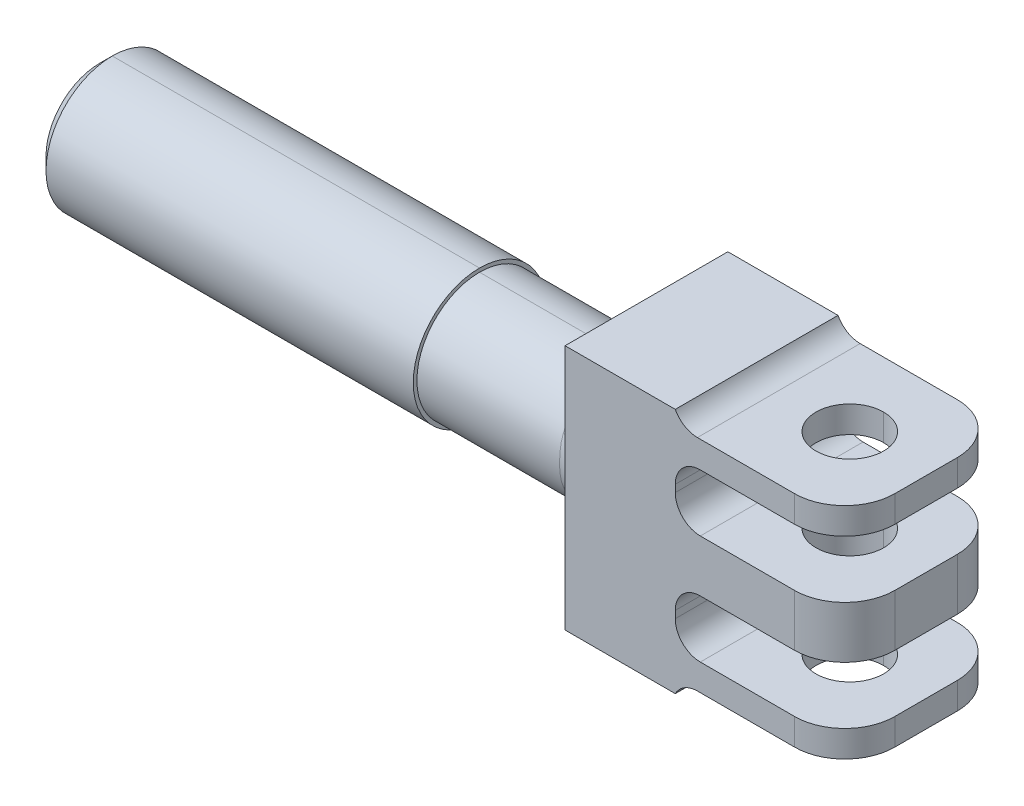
ISO-10303-21;
HEADER;
FILE_DESCRIPTION(('STEP AP214'),'2;1');
FILE_NAME('part.step','',(''),(''),'','','');
FILE_SCHEMA(('AUTOMOTIVE_DESIGN { 1 0 10303 214 1 1 1 1 }'));
ENDSEC;
DATA;
#1=APPLICATION_CONTEXT('core data for automotive mechanical design processes');
#2=APPLICATION_PROTOCOL_DEFINITION('international standard','automotive_design',2000,#1);
#3=PRODUCT_CONTEXT('',#1,'mechanical');
#4=PRODUCT('Part','Part','',(#3));
#5=PRODUCT_RELATED_PRODUCT_CATEGORY('part','',(#4));
#6=PRODUCT_DEFINITION_FORMATION('','',#4);
#7=PRODUCT_DEFINITION_CONTEXT('part definition',#1,'design');
#8=PRODUCT_DEFINITION('design','',#6,#7);
#9=PRODUCT_DEFINITION_SHAPE('','',#8);
#10=(LENGTH_UNIT() NAMED_UNIT(*) SI_UNIT(.MILLI.,.METRE.));
#11=(NAMED_UNIT(*) PLANE_ANGLE_UNIT() SI_UNIT($,.RADIAN.));
#12=(NAMED_UNIT(*) SI_UNIT($,.STERADIAN.) SOLID_ANGLE_UNIT());
#13=UNCERTAINTY_MEASURE_WITH_UNIT(LENGTH_MEASURE(1.E-05),#10,'distance_accuracy_value','');
#14=(GEOMETRIC_REPRESENTATION_CONTEXT(3) GLOBAL_UNCERTAINTY_ASSIGNED_CONTEXT((#13)) GLOBAL_UNIT_ASSIGNED_CONTEXT((#10,
#11,#12)) REPRESENTATION_CONTEXT('',''));
#15=CARTESIAN_POINT('',(0.,0.,0.));
#16=DIRECTION('',(0.,0.,1.));
#17=DIRECTION('',(1.,0.,0.));
#18=AXIS2_PLACEMENT_3D('',#15,#16,#17);
#19=CARTESIAN_POINT('',(-3.00000000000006,2.78365308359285,-6.96428571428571));
#20=CARTESIAN_POINT('',(0.,2.78365308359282,-6.96428571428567));
#21=CARTESIAN_POINT('',(0.,3.89711431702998,-9.75));
#22=CARTESIAN_POINT('',(-2.99999999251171,2.34235478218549,-7.14067442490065));
#23=CARTESIAN_POINT('',(-0.221449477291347,2.43966514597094,-7.10177908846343));
#24=CARTESIAN_POINT('',(0.,3.27921341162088,-9.75));
#25=CARTESIAN_POINT('',(-2.97122055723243,1.88737674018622,-7.27434114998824));
#26=CARTESIAN_POINT('',(-0.367140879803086,1.99576847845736,-7.24754822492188));
#27=CARTESIAN_POINT('',(0.,2.64232743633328,-9.75));
#28=CARTESIAN_POINT('',(-2.93513661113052,1.18370445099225,-7.40985163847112));
#29=CARTESIAN_POINT('',(-0.500567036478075,1.26814519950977,-7.39646887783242));
#30=CARTESIAN_POINT('',(0.,1.65718623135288,-9.75));
#31=CARTESIAN_POINT('',(-2.92406504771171,0.945847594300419,-7.44391771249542));
#32=CARTESIAN_POINT('',(-0.531614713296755,1.0164771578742,-7.43548542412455));
#33=CARTESIAN_POINT('',(0.,1.32418663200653,-9.75));
#34=CARTESIAN_POINT('',(-2.90889211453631,0.472421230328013,-7.4888822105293));
#35=CARTESIAN_POINT('',(-0.571495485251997,0.511379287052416,-7.48689070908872));
#36=CARTESIAN_POINT('',(0.,0.661389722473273,-9.75));
#37=CARTESIAN_POINT('',(-2.90472515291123,0.235681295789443,-7.50003418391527));
#38=CARTESIAN_POINT('',(-0.580976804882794,0.254534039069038,-7.50003965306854));
#39=CARTESIAN_POINT('',(0.,0.329953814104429,-9.75));
#40=CARTESIAN_POINT('',(-2.9047499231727,-0.237851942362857,-7.49996565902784));
#41=CARTESIAN_POINT('',(-0.580918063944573,-0.25688184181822,-7.49996016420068));
#42=CARTESIAN_POINT('',(0.,-0.332992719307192,-9.75));
#43=CARTESIAN_POINT('',(-2.90894188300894,-0.474645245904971,-7.4887452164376));
#44=CARTESIAN_POINT('',(-0.571377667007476,-0.51377752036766,-7.48673069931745));
#45=CARTESIAN_POINT('',(0.,-0.664503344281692,-9.75));
#46=CARTESIAN_POINT('',(-2.92416490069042,-0.948285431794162,-7.44361120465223));
#47=CARTESIAN_POINT('',(-0.531337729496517,-1.01906187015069,-7.43513669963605));
#48=CARTESIAN_POINT('',(0.,-1.32759960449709,-9.75));
#49=CARTESIAN_POINT('',(-2.93526617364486,-1.18636141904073,-7.40941922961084));
#50=CARTESIAN_POINT('',(-0.500162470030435,-1.2709135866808,-7.39598572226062));
#51=CARTESIAN_POINT('',(0.,-1.66090598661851,-9.75));
#52=CARTESIAN_POINT('',(-2.97133295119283,-1.88930575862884,-7.27380991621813));
#53=CARTESIAN_POINT('',(-0.366583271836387,-1.99764437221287,-7.24699136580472));
#54=CARTESIAN_POINT('',(0.,-2.64502806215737,-9.75));
#55=CARTESIAN_POINT('',(-2.99999999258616,-2.34348609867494,-7.14022223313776));
#56=CARTESIAN_POINT('',(-0.220896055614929,-2.44052480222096,-7.10143548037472));
#57=CARTESIAN_POINT('',(0.,-3.28079881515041,-9.75));
#58=CARTESIAN_POINT('',(-3.00000000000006,-2.78365308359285,-6.96428571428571));
#59=CARTESIAN_POINT('',(0.,-2.78365308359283,-6.96428571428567));
#60=CARTESIAN_POINT('',(0.,-3.89711431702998,-9.75));
#61=(BOUNDED_SURFACE() B_SPLINE_SURFACE(3,2,((#19,#20,#21),(#22,#23,#24),(#25,#26,#27),(#28,#29,
#30),(#31,#32,#33),(#34,#35,#36),(#37,#38,#39),(#40,#41,#42),(#43,#44,#45),(#46,#47,#48),(#49,
#50,#51),(#52,#53,#54),(#55,#56,#57),(#58,#59,#60)),.UNSPECIFIED.,.F.,.F.,
.F.) B_SPLINE_SURFACE_WITH_KNOTS((4,2,2,2,2,2,4),(3,3),(0.00664593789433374,0.00865538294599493,
0.00966010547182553,0.0106648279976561,0.0116695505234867,0.0126742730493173,
0.0146837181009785),(0.,1.),
.UNSPECIFIED.) GEOMETRIC_REPRESENTATION_ITEM() RATIONAL_B_SPLINE_SURFACE(((1.,0.70710678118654,
1.),(1.,0.734125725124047,1.),(1.,0.755060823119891,1.),(1.,0.776339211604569,1.),(1.,
0.781712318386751,1.),(1.,0.788810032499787,1.),(1.,0.790574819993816,1.),(1.,0.790563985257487,
1.),(1.,0.788788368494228,1.),(1.,0.781663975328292,1.),(1.,0.776271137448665,1.),(1.,
0.754977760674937,1.),(1.,0.734056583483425,1.),(1.,0.70710678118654,1.))) REPRESENTATION_ITEM('') SURFACE());
#62=CARTESIAN_POINT('',(-3.,3.89711431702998,-9.75));
#63=DIRECTION('',(0.,0.928571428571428,0.371153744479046));
#64=DIRECTION('',(0.,-0.371153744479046,0.928571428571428));
#65=AXIS2_PLACEMENT_3D('',#62,#63,#64);
#66=CIRCLE('',#65,3.);
#67=CARTESIAN_POINT('',(-3.,2.78365308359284,-6.96428571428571));
#68=VERTEX_POINT('',#67);
#69=CARTESIAN_POINT('',(0.,3.89711431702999,-9.75));
#70=VERTEX_POINT('',#69);
#71=EDGE_CURVE('E27',#68,#70,#66,.T.);
#72=DIRECTION('',(0.,-1.,0.));
#73=VECTOR('',#72,1.);
#74=CARTESIAN_POINT('',(0.,14.7499999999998,-9.75));
#75=LINE('',#74,#73);
#76=CARTESIAN_POINT('',(0.,-3.89711431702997,-9.75));
#77=VERTEX_POINT('',#76);
#78=EDGE_CURVE('E475',#70,#77,#75,.T.);
#79=CARTESIAN_POINT('',(-3.,-3.89711431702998,-9.75));
#80=DIRECTION('',(0.,-0.928571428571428,0.371153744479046));
#81=DIRECTION('',(0.,-0.371153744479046,-0.928571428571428));
#82=AXIS2_PLACEMENT_3D('',#79,#80,#81);
#83=CIRCLE('',#82,3.);
#84=CARTESIAN_POINT('',(-3.,-2.78365308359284,-6.96428571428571));
#85=VERTEX_POINT('',#84);
#86=EDGE_CURVE('E10',#77,#85,#83,.T.);
#87=CARTESIAN_POINT('',(-3.00000000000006,-2.78365308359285,-6.96428571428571));
#88=CARTESIAN_POINT('',(-2.99999999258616,-2.34348609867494,-7.14022223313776));
#89=CARTESIAN_POINT('',(-2.97133295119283,-1.88930575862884,-7.27380991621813));
#90=CARTESIAN_POINT('',(-2.93526617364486,-1.18636141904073,-7.40941922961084));
#91=CARTESIAN_POINT('',(-2.92416490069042,-0.948285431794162,-7.44361120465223));
#92=CARTESIAN_POINT('',(-2.90894188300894,-0.474645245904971,-7.4887452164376));
#93=CARTESIAN_POINT('',(-2.9047499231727,-0.237851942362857,-7.49996565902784));
#94=CARTESIAN_POINT('',(-2.90472515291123,0.235681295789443,-7.50003418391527));
#95=CARTESIAN_POINT('',(-2.90889211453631,0.472421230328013,-7.4888822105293));
#96=CARTESIAN_POINT('',(-2.92406504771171,0.945847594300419,-7.44391771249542));
#97=CARTESIAN_POINT('',(-2.93513661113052,1.18370445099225,-7.40985163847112));
#98=CARTESIAN_POINT('',(-2.97122055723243,1.88737674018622,-7.27434114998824));
#99=CARTESIAN_POINT('',(-2.99999999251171,2.34235478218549,-7.14067442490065));
#100=CARTESIAN_POINT('',(-3.00000000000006,2.78365308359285,-6.96428571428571));
#101=(BOUNDED_CURVE() B_SPLINE_CURVE(3,(#87,#88,#89,#90,#91,#92,#93,#94,#95,#96,#97,#98,#99,
#100),.UNSPECIFIED.,.F.,.F.) B_SPLINE_CURVE_WITH_KNOTS((4,2,2,2,2,2,4),(0.00664593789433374,
0.00865538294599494,0.00966010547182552,0.0106648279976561,0.0116695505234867,
0.0126742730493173,0.0146837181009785),
.UNSPECIFIED.) CURVE() GEOMETRIC_REPRESENTATION_ITEM() RATIONAL_B_SPLINE_CURVE((1.,1.,1.,1.,1.,
1.,1.,1.,1.,1.,1.,1.,1.,1.)) REPRESENTATION_ITEM(''));
#102=EDGE_CURVE('E772',#68,#85,#101,.F.);
#103=ORIENTED_EDGE('',*,*,#71,.T.);
#104=ORIENTED_EDGE('',*,*,#78,.T.);
#105=ORIENTED_EDGE('',*,*,#86,.T.);
#106=ORIENTED_EDGE('',*,*,#102,.F.);
#107=EDGE_LOOP('',(#103,#104,#105,#106));
#108=FACE_BOUND('',#107,.T.);
#109=ADVANCED_FACE('F16',(#108),#61,.F.);
#110=CARTESIAN_POINT('',(-3.,0.,0.));
#111=DIRECTION('',(-1.,0.,0.));
#112=DIRECTION('',(0.,-1.,0.));
#113=AXIS2_PLACEMENT_3D('',#110,#111,#112);
#114=TOROIDAL_SURFACE('',#113,10.5,3.);
#115=CARTESIAN_POINT('',(-3.,-10.5,0.));
#116=DIRECTION('',(0.,0.,-1.));
#117=DIRECTION('',(-1.,0.,0.));
#118=AXIS2_PLACEMENT_3D('',#115,#116,#117);
#119=CIRCLE('',#118,3.);
#120=CARTESIAN_POINT('',(-3.,-7.5,0.));
#121=VERTEX_POINT('',#120);
#122=CARTESIAN_POINT('',(0.,-10.5,0.));
#123=VERTEX_POINT('',#122);
#124=EDGE_CURVE('E732',#121,#123,#119,.T.);
#125=ORIENTED_EDGE('',*,*,#124,.F.);
#126=CARTESIAN_POINT('',(-3.,0.,0.));
#127=DIRECTION('',(-1.,0.,0.));
#128=DIRECTION('',(0.,-1.,0.));
#129=AXIS2_PLACEMENT_3D('',#126,#127,#128);
#130=CIRCLE('',#129,7.5);
#131=EDGE_CURVE('E676',#85,#121,#130,.T.);
#132=ORIENTED_EDGE('',*,*,#131,.F.);
#133=ORIENTED_EDGE('',*,*,#86,.F.);
#134=CARTESIAN_POINT('',(0.,0.,0.));
#135=DIRECTION('',(1.,0.,0.));
#136=DIRECTION('',(0.,-1.,0.));
#137=AXIS2_PLACEMENT_3D('',#134,#135,#136);
#138=CIRCLE('',#137,10.5);
#139=EDGE_CURVE('E290',#123,#77,#138,.T.);
#140=ORIENTED_EDGE('',*,*,#139,.F.);
#141=EDGE_LOOP('',(#125,#132,#133,#140));
#142=FACE_BOUND('',#141,.T.);
#143=ADVANCED_FACE('F848',(#142),#114,.F.);
#144=CARTESIAN_POINT('',(-3.,0.,0.));
#145=DIRECTION('',(-1.,0.,0.));
#146=DIRECTION('',(0.,-1.,0.));
#147=AXIS2_PLACEMENT_3D('',#144,#145,#146);
#148=TOROIDAL_SURFACE('',#147,10.5,3.);
#149=CARTESIAN_POINT('',(-3.,3.89711431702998,9.75));
#150=DIRECTION('',(0.,-0.928571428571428,0.371153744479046));
#151=DIRECTION('',(0.,-0.371153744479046,-0.928571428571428));
#152=AXIS2_PLACEMENT_3D('',#149,#150,#151);
#153=CIRCLE('',#152,3.);
#154=CARTESIAN_POINT('',(-3.,2.78365308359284,6.96428571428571));
#155=VERTEX_POINT('',#154);
#156=CARTESIAN_POINT('',(0.,3.89711431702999,9.75));
#157=VERTEX_POINT('',#156);
#158=EDGE_CURVE('E634',#155,#157,#153,.T.);
#159=ORIENTED_EDGE('',*,*,#158,.T.);
#160=CARTESIAN_POINT('',(0.,0.,0.));
#161=DIRECTION('',(1.,0.,0.));
#162=DIRECTION('',(0.,-1.,0.));
#163=AXIS2_PLACEMENT_3D('',#160,#161,#162);
#164=CIRCLE('',#163,10.5);
#165=EDGE_CURVE('E500',#70,#157,#164,.T.);
#166=ORIENTED_EDGE('',*,*,#165,.F.);
#167=ORIENTED_EDGE('',*,*,#71,.F.);
#168=CARTESIAN_POINT('',(-3.,0.,0.));
#169=DIRECTION('',(-1.,0.,0.));
#170=DIRECTION('',(0.,-1.,0.));
#171=AXIS2_PLACEMENT_3D('',#168,#169,#170);
#172=CIRCLE('',#171,7.5);
#173=CARTESIAN_POINT('',(-3.,7.5,0.));
#174=VERTEX_POINT('',#173);
#175=EDGE_CURVE('E595',#174,#68,#172,.T.);
#176=ORIENTED_EDGE('',*,*,#175,.F.);
#177=CARTESIAN_POINT('',(-3.,0.,0.));
#178=DIRECTION('',(-1.,0.,0.));
#179=DIRECTION('',(0.,-1.,0.));
#180=AXIS2_PLACEMENT_3D('',#177,#178,#179);
#181=CIRCLE('',#180,7.5);
#182=EDGE_CURVE('E952',#155,#174,#181,.T.);
#183=ORIENTED_EDGE('',*,*,#182,.F.);
#184=EDGE_LOOP('',(#159,#166,#167,#176,#183));
#185=FACE_BOUND('',#184,.T.);
#186=ADVANCED_FACE('F985',(#185),#148,.F.);
#187=CARTESIAN_POINT('',(-3.00000000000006,-2.78365308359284,6.96428571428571));
#188=CARTESIAN_POINT('',(0.,-2.78365308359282,6.96428571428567));
#189=CARTESIAN_POINT('',(0.,-3.89711431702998,9.75));
#190=CARTESIAN_POINT('',(-2.99999999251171,-2.34235478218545,7.14067442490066));
#191=CARTESIAN_POINT('',(-0.221449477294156,-2.43966514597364,7.10177908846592));
#192=CARTESIAN_POINT('',(0.,-3.27921341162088,9.75));
#193=CARTESIAN_POINT('',(-2.97122055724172,-1.88737674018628,7.27434114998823));
#194=CARTESIAN_POINT('',(-0.367140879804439,-1.99576847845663,7.24754822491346));
#195=CARTESIAN_POINT('',(0.,-2.64232743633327,9.75));
#196=CARTESIAN_POINT('',(-2.93513661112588,-1.18370445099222,7.40985163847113));
#197=CARTESIAN_POINT('',(-0.500567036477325,-1.26814519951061,7.39646887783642));
#198=CARTESIAN_POINT('',(0.,-1.65718623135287,9.75));
#199=CARTESIAN_POINT('',(-2.92406504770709,-0.945847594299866,7.44391771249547));
#200=CARTESIAN_POINT('',(-0.531614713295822,-1.0164771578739,7.43548542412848));
#201=CARTESIAN_POINT('',(0.,-1.32418663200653,9.75));
#202=CARTESIAN_POINT('',(-2.90889211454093,-0.472421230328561,7.48888221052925));
#203=CARTESIAN_POINT('',(-0.571495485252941,-0.51137928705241,7.48689070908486));
#204=CARTESIAN_POINT('',(0.,-0.66138972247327,9.75));
#205=CARTESIAN_POINT('',(-2.90472515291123,-0.23568129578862,7.50003418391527));
#206=CARTESIAN_POINT('',(-0.580976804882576,-0.254534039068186,7.50003965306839));
#207=CARTESIAN_POINT('',(0.,-0.32995381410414,9.75));
#208=CARTESIAN_POINT('',(-2.9047499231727,0.237851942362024,7.49996565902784));
#209=CARTESIAN_POINT('',(-0.580918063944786,0.256881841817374,7.49996016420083));
#210=CARTESIAN_POINT('',(0.,0.332992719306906,9.75));
#211=CARTESIAN_POINT('',(-2.90894188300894,0.474645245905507,7.48874521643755));
#212=CARTESIAN_POINT('',(-0.571377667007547,0.513777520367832,7.48673069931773));
#213=CARTESIAN_POINT('',(0.,0.664503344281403,9.75));
#214=CARTESIAN_POINT('',(-2.92416490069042,0.948285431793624,7.44361120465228));
#215=CARTESIAN_POINT('',(-0.531337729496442,1.0190618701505,7.43513669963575));
#216=CARTESIAN_POINT('',(0.,1.32759960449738,9.75));
#217=CARTESIAN_POINT('',(-2.93526617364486,1.18636141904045,7.4094192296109));
#218=CARTESIAN_POINT('',(-0.500162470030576,1.27091358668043,7.39598572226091));
#219=CARTESIAN_POINT('',(0.,1.66090598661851,9.75));
#220=CARTESIAN_POINT('',(-2.97133295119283,1.88930575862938,7.27380991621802));
#221=CARTESIAN_POINT('',(-0.366583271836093,1.99764437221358,7.24699136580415));
#222=CARTESIAN_POINT('',(0.,2.64502806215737,9.75));
#223=CARTESIAN_POINT('',(-2.99999999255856,2.34348609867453,7.14022223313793));
#224=CARTESIAN_POINT('',(-0.22089605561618,2.44052480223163,7.10143548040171));
#225=CARTESIAN_POINT('',(0.,3.28079881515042,9.75));
#226=CARTESIAN_POINT('',(-3.00000000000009,2.78365308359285,6.96428571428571));
#227=CARTESIAN_POINT('',(0.,2.78365308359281,6.96428571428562));
#228=CARTESIAN_POINT('',(0.,3.89711431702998,9.75));
#229=(BOUNDED_SURFACE() B_SPLINE_SURFACE(3,2,((#187,#188,#189),(#190,#191,#192),(#193,#194,
#195),(#196,#197,#198),(#199,#200,#201),(#202,#203,#204),(#205,#206,#207),(#208,#209,#210),
(#211,#212,#213),(#214,#215,#216),(#217,#218,#219),(#220,#221,#222),(#223,#224,#225),(#226,#227,
#228)),.UNSPECIFIED.,.F.,.F.,.F.) B_SPLINE_SURFACE_WITH_KNOTS((4,2,2,2,2,2,4),(3,3),
(0.00664593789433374,0.00865538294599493,0.00966010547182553,0.0106648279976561,
0.0116695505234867,0.0126742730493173,0.0146837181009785),(0.,1.),
.UNSPECIFIED.) GEOMETRIC_REPRESENTATION_ITEM() RATIONAL_B_SPLINE_SURFACE(((1.,0.70710678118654,
1.),(1.,0.734125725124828,1.),(1.,0.75506082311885,1.),(1.,0.776339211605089,1.),(1.,
0.781712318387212,1.),(1.,0.788810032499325,1.),(1.,0.790574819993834,1.),(1.,0.790563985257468,
1.),(1.,0.788788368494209,1.),(1.,0.78166397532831,1.),(1.,0.776271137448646,1.),(1.,
0.754977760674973,1.),(1.,0.7340565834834,1.),(1.,0.707106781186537,1.))) REPRESENTATION_ITEM('') SURFACE());
#230=CARTESIAN_POINT('',(-3.,-3.89711431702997,9.75));
#231=DIRECTION('',(0.,0.928571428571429,0.371153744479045));
#232=DIRECTION('',(0.,0.371153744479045,-0.928571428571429));
#233=AXIS2_PLACEMENT_3D('',#230,#231,#232);
#234=CIRCLE('',#233,3.);
#235=CARTESIAN_POINT('',(0.,-3.89711431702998,9.75));
#236=VERTEX_POINT('',#235);
#237=CARTESIAN_POINT('',(-3.,-2.78365308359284,6.96428571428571));
#238=VERTEX_POINT('',#237);
#239=EDGE_CURVE('E528',#236,#238,#234,.T.);
#240=DIRECTION('',(0.,-1.,0.));
#241=VECTOR('',#240,1.);
#242=CARTESIAN_POINT('',(0.,14.7499999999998,9.75));
#243=LINE('',#242,#241);
#244=EDGE_CURVE('E302',#157,#236,#243,.T.);
#245=CARTESIAN_POINT('',(-3.00000000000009,2.78365308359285,6.96428571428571));
#246=CARTESIAN_POINT('',(-2.99999999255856,2.34348609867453,7.14022223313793));
#247=CARTESIAN_POINT('',(-2.97133295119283,1.88930575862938,7.27380991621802));
#248=CARTESIAN_POINT('',(-2.93526617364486,1.18636141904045,7.4094192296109));
#249=CARTESIAN_POINT('',(-2.92416490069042,0.948285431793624,7.44361120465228));
#250=CARTESIAN_POINT('',(-2.90894188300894,0.474645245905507,7.48874521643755));
#251=CARTESIAN_POINT('',(-2.9047499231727,0.237851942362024,7.49996565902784));
#252=CARTESIAN_POINT('',(-2.90472515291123,-0.23568129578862,7.50003418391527));
#253=CARTESIAN_POINT('',(-2.90889211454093,-0.472421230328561,7.48888221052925));
#254=CARTESIAN_POINT('',(-2.92406504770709,-0.945847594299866,7.44391771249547));
#255=CARTESIAN_POINT('',(-2.93513661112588,-1.18370445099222,7.40985163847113));
#256=CARTESIAN_POINT('',(-2.97122055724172,-1.88737674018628,7.27434114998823));
#257=CARTESIAN_POINT('',(-2.99999999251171,-2.34235478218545,7.14067442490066));
#258=CARTESIAN_POINT('',(-3.00000000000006,-2.78365308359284,6.96428571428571));
#259=(BOUNDED_CURVE() B_SPLINE_CURVE(3,(#245,#246,#247,#248,#249,#250,#251,#252,#253,#254,#255,
#256,#257,#258),.UNSPECIFIED.,.F.,.F.) B_SPLINE_CURVE_WITH_KNOTS((4,2,2,2,2,2,4),
(0.00664593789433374,0.00865538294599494,0.00966010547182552,0.0106648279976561,
0.0116695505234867,0.0126742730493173,0.0146837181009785),
.UNSPECIFIED.) CURVE() GEOMETRIC_REPRESENTATION_ITEM() RATIONAL_B_SPLINE_CURVE((1.,1.,1.,1.,1.,
1.,1.,1.,1.,1.,1.,1.,1.,1.)) REPRESENTATION_ITEM(''));
#260=EDGE_CURVE('E588',#238,#155,#259,.F.);
#261=ORIENTED_EDGE('',*,*,#239,.F.);
#262=ORIENTED_EDGE('',*,*,#244,.F.);
#263=ORIENTED_EDGE('',*,*,#158,.F.);
#264=ORIENTED_EDGE('',*,*,#260,.F.);
#265=EDGE_LOOP('',(#261,#262,#263,#264));
#266=FACE_BOUND('',#265,.T.);
#267=ADVANCED_FACE('F789',(#266),#229,.F.);
#268=CARTESIAN_POINT('',(24.36,-13.1500000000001,0.));
#269=DIRECTION('',(0.,-1.,0.));
#270=DIRECTION('',(0.,0.,-1.));
#271=AXIS2_PLACEMENT_3D('',#268,#269,#270);
#272=CYLINDRICAL_SURFACE('',#271,4.05);
#273=DIRECTION('',(0.,-1.,0.));
#274=VECTOR('',#273,1.);
#275=CARTESIAN_POINT('',(24.36,-13.1500000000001,4.05));
#276=LINE('',#275,#274);
#277=CARTESIAN_POINT('',(24.36,3.11,4.05));
#278=VERTEX_POINT('',#277);
#279=CARTESIAN_POINT('',(24.36,-3.11,4.05));
#280=VERTEX_POINT('',#279);
#281=EDGE_CURVE('E527',#278,#280,#276,.T.);
#282=ORIENTED_EDGE('',*,*,#281,.F.);
#283=CARTESIAN_POINT('',(24.36,3.11,0.));
#284=DIRECTION('',(0.,1.,0.));
#285=DIRECTION('',(-1.,0.,0.));
#286=AXIS2_PLACEMENT_3D('',#283,#284,#285);
#287=CIRCLE('',#286,4.05);
#288=CARTESIAN_POINT('',(24.36,3.11,-4.05));
#289=VERTEX_POINT('',#288);
#290=EDGE_CURVE('E470',#278,#289,#287,.T.);
#291=ORIENTED_EDGE('',*,*,#290,.T.);
#292=DIRECTION('',(0.,-1.,0.));
#293=VECTOR('',#292,1.);
#294=CARTESIAN_POINT('',(24.36,-13.1500000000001,-4.05));
#295=LINE('',#294,#293);
#296=CARTESIAN_POINT('',(24.36,-3.11,-4.05));
#297=VERTEX_POINT('',#296);
#298=EDGE_CURVE('E495',#289,#297,#295,.T.);
#299=ORIENTED_EDGE('',*,*,#298,.T.);
#300=CARTESIAN_POINT('',(24.36,-3.11,0.));
#301=DIRECTION('',(0.,-1.,0.));
#302=DIRECTION('',(1.,0.,0.));
#303=AXIS2_PLACEMENT_3D('',#300,#301,#302);
#304=CIRCLE('',#303,4.05);
#305=EDGE_CURVE('E375',#297,#280,#304,.T.);
#306=ORIENTED_EDGE('',*,*,#305,.T.);
#307=EDGE_LOOP('',(#282,#291,#299,#306));
#308=FACE_BOUND('',#307,.T.);
#309=ADVANCED_FACE('F1077',(#308),#272,.F.);
#310=CARTESIAN_POINT('',(24.36,-13.1500000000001,0.));
#311=DIRECTION('',(0.,-1.,0.));
#312=DIRECTION('',(0.,0.,-1.));
#313=AXIS2_PLACEMENT_3D('',#310,#311,#312);
#314=CYLINDRICAL_SURFACE('',#313,4.05);
#315=DIRECTION('',(0.,-1.,0.));
#316=VECTOR('',#315,1.);
#317=CARTESIAN_POINT('',(24.36,-13.1500000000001,4.05));
#318=LINE('',#317,#316);
#319=CARTESIAN_POINT('',(24.36,13.1500000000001,4.05));
#320=VERTEX_POINT('',#319);
#321=CARTESIAN_POINT('',(24.36,9.97000000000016,4.05));
#322=VERTEX_POINT('',#321);
#323=EDGE_CURVE('E407',#320,#322,#318,.T.);
#324=ORIENTED_EDGE('',*,*,#323,.F.);
#325=CARTESIAN_POINT('',(24.36,13.1500000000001,0.));
#326=DIRECTION('',(0.,1.,0.));
#327=DIRECTION('',(-1.,0.,0.));
#328=AXIS2_PLACEMENT_3D('',#325,#326,#327);
#329=CIRCLE('',#328,4.05);
#330=CARTESIAN_POINT('',(24.36,13.1500000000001,-4.05));
#331=VERTEX_POINT('',#330);
#332=EDGE_CURVE('E424',#320,#331,#329,.T.);
#333=ORIENTED_EDGE('',*,*,#332,.T.);
#334=DIRECTION('',(0.,-1.,0.));
#335=VECTOR('',#334,1.);
#336=CARTESIAN_POINT('',(24.36,-13.1500000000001,-4.05));
#337=LINE('',#336,#335);
#338=CARTESIAN_POINT('',(24.36,9.97000000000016,-4.05));
#339=VERTEX_POINT('',#338);
#340=EDGE_CURVE('E406',#331,#339,#337,.T.);
#341=ORIENTED_EDGE('',*,*,#340,.T.);
#342=CARTESIAN_POINT('',(24.36,9.97000000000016,0.));
#343=DIRECTION('',(0.,-1.,0.));
#344=DIRECTION('',(0.,0.,-1.));
#345=AXIS2_PLACEMENT_3D('',#342,#343,#344);
#346=CIRCLE('',#345,4.05);
#347=EDGE_CURVE('E457',#339,#322,#346,.T.);
#348=ORIENTED_EDGE('',*,*,#347,.T.);
#349=EDGE_LOOP('',(#324,#333,#341,#348));
#350=FACE_BOUND('',#349,.T.);
#351=ADVANCED_FACE('F1083',(#350),#314,.F.);
#352=CARTESIAN_POINT('',(24.36,-13.1500000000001,0.));
#353=DIRECTION('',(0.,-1.,0.));
#354=DIRECTION('',(0.,0.,-1.));
#355=AXIS2_PLACEMENT_3D('',#352,#353,#354);
#356=CYLINDRICAL_SURFACE('',#355,4.05);
#357=DIRECTION('',(0.,-1.,0.));
#358=VECTOR('',#357,1.);
#359=CARTESIAN_POINT('',(24.36,-13.1500000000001,4.05));
#360=LINE('',#359,#358);
#361=CARTESIAN_POINT('',(24.36,-9.97000000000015,4.05));
#362=VERTEX_POINT('',#361);
#363=CARTESIAN_POINT('',(24.36,-13.1500000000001,4.05));
#364=VERTEX_POINT('',#363);
#365=EDGE_CURVE('E560',#362,#364,#360,.T.);
#366=ORIENTED_EDGE('',*,*,#365,.F.);
#367=CARTESIAN_POINT('',(24.36,-9.97000000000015,0.));
#368=DIRECTION('',(0.,1.,0.));
#369=DIRECTION('',(0.,0.,1.));
#370=AXIS2_PLACEMENT_3D('',#367,#368,#369);
#371=CIRCLE('',#370,4.05);
#372=CARTESIAN_POINT('',(24.36,-9.97000000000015,-4.05));
#373=VERTEX_POINT('',#372);
#374=EDGE_CURVE('E547',#362,#373,#371,.T.);
#375=ORIENTED_EDGE('',*,*,#374,.T.);
#376=DIRECTION('',(0.,-1.,0.));
#377=VECTOR('',#376,1.);
#378=CARTESIAN_POINT('',(24.36,-13.1500000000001,-4.05));
#379=LINE('',#378,#377);
#380=CARTESIAN_POINT('',(24.36,-13.1500000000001,-4.05));
#381=VERTEX_POINT('',#380);
#382=EDGE_CURVE('E536',#373,#381,#379,.T.);
#383=ORIENTED_EDGE('',*,*,#382,.T.);
#384=CARTESIAN_POINT('',(24.36,-13.1500000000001,0.));
#385=DIRECTION('',(0.,-1.,0.));
#386=DIRECTION('',(0.,0.,-1.));
#387=AXIS2_PLACEMENT_3D('',#384,#385,#386);
#388=CIRCLE('',#387,4.05);
#389=EDGE_CURVE('E726',#381,#364,#388,.T.);
#390=ORIENTED_EDGE('',*,*,#389,.T.);
#391=EDGE_LOOP('',(#366,#375,#383,#390));
#392=FACE_BOUND('',#391,.T.);
#393=ADVANCED_FACE('F819',(#392),#356,.F.);
#394=CARTESIAN_POINT('',(-65.5,2.38581391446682E-13,0.));
#395=DIRECTION('',(1.,0.,0.));
#396=DIRECTION('',(0.,1.,0.));
#397=AXIS2_PLACEMENT_3D('',#394,#395,#396);
#398=CONICAL_SURFACE('',#397,6.43749999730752,0.785398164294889);
#399=DIRECTION('',(0.707106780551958,-0.707106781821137,0.));
#400=VECTOR('',#399,1.);
#401=CARTESIAN_POINT('',(-65.5,-6.43749999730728,0.));
#402=LINE('',#401,#400);
#403=CARTESIAN_POINT('',(-65.5,-6.43749999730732,0.));
#404=VERTEX_POINT('',#403);
#405=CARTESIAN_POINT('',(-64.,-7.93749999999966,0.));
#406=VERTEX_POINT('',#405);
#407=EDGE_CURVE('E413',#404,#406,#402,.T.);
#408=ORIENTED_EDGE('',*,*,#407,.F.);
#409=CARTESIAN_POINT('',(-65.5,2.38581391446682E-13,0.));
#410=DIRECTION('',(-1.,0.,0.));
#411=DIRECTION('',(0.,1.,0.));
#412=AXIS2_PLACEMENT_3D('',#409,#410,#411);
#413=CIRCLE('',#412,6.43749999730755);
#414=CARTESIAN_POINT('',(-65.5,6.43749999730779,0.));
#415=VERTEX_POINT('',#414);
#416=EDGE_CURVE('E631',#415,#404,#413,.T.);
#417=ORIENTED_EDGE('',*,*,#416,.F.);
#418=DIRECTION('',(0.707106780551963,0.707106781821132,0.));
#419=VECTOR('',#418,1.);
#420=CARTESIAN_POINT('',(-65.5,6.43749999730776,0.));
#421=LINE('',#420,#419);
#422=CARTESIAN_POINT('',(-64.,7.93750000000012,0.));
#423=VERTEX_POINT('',#422);
#424=EDGE_CURVE('E412',#415,#423,#421,.T.);
#425=ORIENTED_EDGE('',*,*,#424,.T.);
#426=CARTESIAN_POINT('',(-64.,2.33117695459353E-13,0.));
#427=DIRECTION('',(1.,0.,0.));
#428=DIRECTION('',(0.,1.,0.));
#429=AXIS2_PLACEMENT_3D('',#426,#427,#428);
#430=CIRCLE('',#429,7.93749999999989);
#431=EDGE_CURVE('E622',#406,#423,#430,.T.);
#432=ORIENTED_EDGE('',*,*,#431,.F.);
#433=EDGE_LOOP('',(#408,#417,#425,#432));
#434=FACE_BOUND('',#433,.T.);
#435=ADVANCED_FACE('F815',(#434),#398,.T.);
#436=CARTESIAN_POINT('',(15.8532998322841,16.15,-9.75));
#437=DIRECTION('',(0.,0.,1.));
#438=DIRECTION('',(1.,0.,0.));
#439=AXIS2_PLACEMENT_3D('',#436,#437,#438);
#440=CYLINDRICAL_SURFACE('',#439,3.);
#441=CARTESIAN_POINT('',(15.8532998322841,16.15,-9.75));
#442=DIRECTION('',(0.,0.,1.));
#443=DIRECTION('',(-1.,0.,0.));
#444=AXIS2_PLACEMENT_3D('',#441,#442,#443);
#445=CIRCLE('',#444,3.);
#446=CARTESIAN_POINT('',(13.2,14.7499999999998,-9.75));
#447=VERTEX_POINT('',#446);
#448=CARTESIAN_POINT('',(15.8532998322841,13.1500000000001,-9.75));
#449=VERTEX_POINT('',#448);
#450=EDGE_CURVE('E471',#447,#449,#445,.T.);
#451=ORIENTED_EDGE('',*,*,#450,.F.);
#452=DIRECTION('',(0.,0.,1.));
#453=VECTOR('',#452,1.);
#454=CARTESIAN_POINT('',(13.2,14.7499999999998,-9.75));
#455=LINE('',#454,#453);
#456=CARTESIAN_POINT('',(13.2,14.7499999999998,9.75));
#457=VERTEX_POINT('',#456);
#458=EDGE_CURVE('E545',#447,#457,#455,.T.);
#459=ORIENTED_EDGE('',*,*,#458,.T.);
#460=CARTESIAN_POINT('',(15.8532998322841,16.15,9.75));
#461=DIRECTION('',(0.,0.,-1.));
#462=DIRECTION('',(-1.,0.,0.));
#463=AXIS2_PLACEMENT_3D('',#460,#461,#462);
#464=CIRCLE('',#463,3.);
#465=CARTESIAN_POINT('',(15.8532998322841,13.1500000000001,9.75));
#466=VERTEX_POINT('',#465);
#467=EDGE_CURVE('E400',#466,#457,#464,.T.);
#468=ORIENTED_EDGE('',*,*,#467,.F.);
#469=DIRECTION('',(0.,0.,1.));
#470=VECTOR('',#469,1.);
#471=CARTESIAN_POINT('',(15.8532998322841,13.1500000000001,9.75));
#472=LINE('',#471,#470);
#473=EDGE_CURVE('E501',#449,#466,#472,.T.);
#474=ORIENTED_EDGE('',*,*,#473,.F.);
#475=EDGE_LOOP('',(#451,#459,#468,#474));
#476=FACE_BOUND('',#475,.T.);
#477=ADVANCED_FACE('F818',(#476),#440,.F.);
#478=CARTESIAN_POINT('',(16.2,6.97000000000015,-9.75));
#479=DIRECTION('',(0.,0.,-1.));
#480=DIRECTION('',(-1.,0.,0.));
#481=AXIS2_PLACEMENT_3D('',#478,#479,#480);
#482=CYLINDRICAL_SURFACE('',#481,3.);
#483=CARTESIAN_POINT('',(16.2,6.97000000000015,-9.75));
#484=DIRECTION('',(0.,0.,1.));
#485=DIRECTION('',(-1.,0.,0.));
#486=AXIS2_PLACEMENT_3D('',#483,#484,#485);
#487=CIRCLE('',#486,3.);
#488=CARTESIAN_POINT('',(16.2,9.97000000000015,-9.75));
#489=VERTEX_POINT('',#488);
#490=CARTESIAN_POINT('',(13.2,6.97000000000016,-9.75));
#491=VERTEX_POINT('',#490);
#492=EDGE_CURVE('E42',#489,#491,#487,.T.);
#493=ORIENTED_EDGE('',*,*,#492,.F.);
#494=DIRECTION('',(0.,0.,-1.));
#495=VECTOR('',#494,1.);
#496=CARTESIAN_POINT('',(16.2,9.97000000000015,-9.75));
#497=LINE('',#496,#495);
#498=CARTESIAN_POINT('',(16.2,9.97000000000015,9.75));
#499=VERTEX_POINT('',#498);
#500=EDGE_CURVE('E742',#499,#489,#497,.T.);
#501=ORIENTED_EDGE('',*,*,#500,.F.);
#502=CARTESIAN_POINT('',(16.2,6.97000000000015,9.75));
#503=DIRECTION('',(0.,0.,-1.));
#504=DIRECTION('',(-1.,0.,0.));
#505=AXIS2_PLACEMENT_3D('',#502,#503,#504);
#506=CIRCLE('',#505,3.);
#507=CARTESIAN_POINT('',(13.2,6.97000000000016,9.75));
#508=VERTEX_POINT('',#507);
#509=EDGE_CURVE('E401',#508,#499,#506,.T.);
#510=ORIENTED_EDGE('',*,*,#509,.F.);
#511=DIRECTION('',(0.,0.,1.));
#512=VECTOR('',#511,1.);
#513=CARTESIAN_POINT('',(13.2,6.97000000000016,9.75));
#514=LINE('',#513,#512);
#515=EDGE_CURVE('E463',#491,#508,#514,.T.);
#516=ORIENTED_EDGE('',*,*,#515,.F.);
#517=EDGE_LOOP('',(#493,#501,#510,#516));
#518=FACE_BOUND('',#517,.T.);
#519=ADVANCED_FACE('F808',(#518),#482,.F.);
#520=CARTESIAN_POINT('',(16.2,6.11,-9.75));
#521=DIRECTION('',(0.,0.,-1.));
#522=DIRECTION('',(-1.,0.,0.));
#523=AXIS2_PLACEMENT_3D('',#520,#521,#522);
#524=CYLINDRICAL_SURFACE('',#523,3.);
#525=CARTESIAN_POINT('',(16.2,6.11,-9.75));
#526=DIRECTION('',(0.,0.,1.));
#527=DIRECTION('',(-1.,0.,0.));
#528=AXIS2_PLACEMENT_3D('',#525,#526,#527);
#529=CIRCLE('',#528,3.);
#530=CARTESIAN_POINT('',(13.2,6.11,-9.75));
#531=VERTEX_POINT('',#530);
#532=CARTESIAN_POINT('',(16.2,3.11,-9.75));
#533=VERTEX_POINT('',#532);
#534=EDGE_CURVE('E386',#531,#533,#529,.T.);
#535=ORIENTED_EDGE('',*,*,#534,.F.);
#536=DIRECTION('',(0.,0.,-1.));
#537=VECTOR('',#536,1.);
#538=CARTESIAN_POINT('',(13.2,6.11,-9.75));
#539=LINE('',#538,#537);
#540=CARTESIAN_POINT('',(13.2,6.11,9.75));
#541=VERTEX_POINT('',#540);
#542=EDGE_CURVE('E464',#541,#531,#539,.T.);
#543=ORIENTED_EDGE('',*,*,#542,.F.);
#544=CARTESIAN_POINT('',(16.2,6.11,9.75));
#545=DIRECTION('',(0.,0.,-1.));
#546=DIRECTION('',(-1.,0.,0.));
#547=AXIS2_PLACEMENT_3D('',#544,#545,#546);
#548=CIRCLE('',#547,3.);
#549=CARTESIAN_POINT('',(16.2,3.11,9.75));
#550=VERTEX_POINT('',#549);
#551=EDGE_CURVE('E623',#550,#541,#548,.T.);
#552=ORIENTED_EDGE('',*,*,#551,.F.);
#553=DIRECTION('',(0.,0.,1.));
#554=VECTOR('',#553,1.);
#555=CARTESIAN_POINT('',(16.2,3.11,9.75));
#556=LINE('',#555,#554);
#557=EDGE_CURVE('E614',#533,#550,#556,.T.);
#558=ORIENTED_EDGE('',*,*,#557,.F.);
#559=EDGE_LOOP('',(#535,#543,#552,#558));
#560=FACE_BOUND('',#559,.T.);
#561=ADVANCED_FACE('F804',(#560),#524,.F.);
#562=CARTESIAN_POINT('',(16.2,-6.11,-9.75));
#563=DIRECTION('',(0.,0.,-1.));
#564=DIRECTION('',(-1.,0.,0.));
#565=AXIS2_PLACEMENT_3D('',#562,#563,#564);
#566=CYLINDRICAL_SURFACE('',#565,3.);
#567=CARTESIAN_POINT('',(16.2,-6.11,-9.75));
#568=DIRECTION('',(0.,0.,1.));
#569=DIRECTION('',(-1.,0.,0.));
#570=AXIS2_PLACEMENT_3D('',#567,#568,#569);
#571=CIRCLE('',#570,3.);
#572=CARTESIAN_POINT('',(16.2,-3.11,-9.75));
#573=VERTEX_POINT('',#572);
#574=CARTESIAN_POINT('',(13.2,-6.11,-9.75));
#575=VERTEX_POINT('',#574);
#576=EDGE_CURVE('E508',#573,#575,#571,.T.);
#577=ORIENTED_EDGE('',*,*,#576,.F.);
#578=DIRECTION('',(0.,0.,-1.));
#579=VECTOR('',#578,1.);
#580=CARTESIAN_POINT('',(16.2,-3.11,-9.75));
#581=LINE('',#580,#579);
#582=CARTESIAN_POINT('',(16.2,-3.11,9.75));
#583=VERTEX_POINT('',#582);
#584=EDGE_CURVE('E446',#583,#573,#581,.T.);
#585=ORIENTED_EDGE('',*,*,#584,.F.);
#586=CARTESIAN_POINT('',(16.2,-6.11,9.75));
#587=DIRECTION('',(0.,0.,-1.));
#588=DIRECTION('',(-1.,0.,0.));
#589=AXIS2_PLACEMENT_3D('',#586,#587,#588);
#590=CIRCLE('',#589,3.);
#591=CARTESIAN_POINT('',(13.2,-6.11,9.75));
#592=VERTEX_POINT('',#591);
#593=EDGE_CURVE('E102',#592,#583,#590,.T.);
#594=ORIENTED_EDGE('',*,*,#593,.F.);
#595=DIRECTION('',(0.,0.,1.));
#596=VECTOR('',#595,1.);
#597=CARTESIAN_POINT('',(13.2,-6.11,9.75));
#598=LINE('',#597,#596);
#599=EDGE_CURVE('E373',#575,#592,#598,.T.);
#600=ORIENTED_EDGE('',*,*,#599,.F.);
#601=EDGE_LOOP('',(#577,#585,#594,#600));
#602=FACE_BOUND('',#601,.T.);
#603=ADVANCED_FACE('F807',(#602),#566,.F.);
#604=CARTESIAN_POINT('',(16.2,-6.97000000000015,-9.75));
#605=DIRECTION('',(0.,0.,-1.));
#606=DIRECTION('',(-1.,0.,0.));
#607=AXIS2_PLACEMENT_3D('',#604,#605,#606);
#608=CYLINDRICAL_SURFACE('',#607,3.);
#609=CARTESIAN_POINT('',(16.2,-6.97000000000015,-9.75));
#610=DIRECTION('',(0.,0.,1.));
#611=DIRECTION('',(-1.,0.,0.));
#612=AXIS2_PLACEMENT_3D('',#609,#610,#611);
#613=CIRCLE('',#612,3.);
#614=CARTESIAN_POINT('',(13.2,-6.97000000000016,-9.75));
#615=VERTEX_POINT('',#614);
#616=CARTESIAN_POINT('',(16.2,-9.97000000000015,-9.75));
#617=VERTEX_POINT('',#616);
#618=EDGE_CURVE('E363',#615,#617,#613,.T.);
#619=ORIENTED_EDGE('',*,*,#618,.F.);
#620=DIRECTION('',(0.,0.,-1.));
#621=VECTOR('',#620,1.);
#622=CARTESIAN_POINT('',(13.2,-6.97000000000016,-9.75));
#623=LINE('',#622,#621);
#624=CARTESIAN_POINT('',(13.2,-6.97000000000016,9.75));
#625=VERTEX_POINT('',#624);
#626=EDGE_CURVE('E361',#625,#615,#623,.T.);
#627=ORIENTED_EDGE('',*,*,#626,.F.);
#628=CARTESIAN_POINT('',(16.2,-6.97000000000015,9.75));
#629=DIRECTION('',(0.,0.,-1.));
#630=DIRECTION('',(-1.,0.,0.));
#631=AXIS2_PLACEMENT_3D('',#628,#629,#630);
#632=CIRCLE('',#631,3.);
#633=CARTESIAN_POINT('',(16.2,-9.97000000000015,9.75));
#634=VERTEX_POINT('',#633);
#635=EDGE_CURVE('E346',#634,#625,#632,.T.);
#636=ORIENTED_EDGE('',*,*,#635,.F.);
#637=DIRECTION('',(0.,0.,1.));
#638=VECTOR('',#637,1.);
#639=CARTESIAN_POINT('',(16.2,-9.97000000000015,9.75));
#640=LINE('',#639,#638);
#641=EDGE_CURVE('E479',#617,#634,#640,.T.);
#642=ORIENTED_EDGE('',*,*,#641,.F.);
#643=EDGE_LOOP('',(#619,#627,#636,#642));
#644=FACE_BOUND('',#643,.T.);
#645=ADVANCED_FACE('F362',(#644),#608,.F.);
#646=CARTESIAN_POINT('',(15.8532998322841,-16.15,-9.75));
#647=DIRECTION('',(0.,0.,-1.));
#648=DIRECTION('',(-1.,0.,0.));
#649=AXIS2_PLACEMENT_3D('',#646,#647,#648);
#650=CYLINDRICAL_SURFACE('',#649,3.);
#651=CARTESIAN_POINT('',(15.8532998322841,-16.15,-9.75));
#652=DIRECTION('',(0.,0.,1.));
#653=DIRECTION('',(-1.,0.,0.));
#654=AXIS2_PLACEMENT_3D('',#651,#652,#653);
#655=CIRCLE('',#654,3.);
#656=CARTESIAN_POINT('',(15.8532998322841,-13.1500000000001,-9.75));
#657=VERTEX_POINT('',#656);
#658=CARTESIAN_POINT('',(13.2,-14.7499999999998,-9.75));
#659=VERTEX_POINT('',#658);
#660=EDGE_CURVE('E483',#657,#659,#655,.T.);
#661=ORIENTED_EDGE('',*,*,#660,.F.);
#662=DIRECTION('',(0.,0.,-1.));
#663=VECTOR('',#662,1.);
#664=CARTESIAN_POINT('',(15.8532998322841,-13.1500000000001,-9.75));
#665=LINE('',#664,#663);
#666=CARTESIAN_POINT('',(15.8532998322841,-13.1500000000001,9.75));
#667=VERTEX_POINT('',#666);
#668=EDGE_CURVE('E666',#667,#657,#665,.T.);
#669=ORIENTED_EDGE('',*,*,#668,.F.);
#670=CARTESIAN_POINT('',(15.8532998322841,-16.15,9.75));
#671=DIRECTION('',(0.,0.,-1.));
#672=DIRECTION('',(-1.,0.,0.));
#673=AXIS2_PLACEMENT_3D('',#670,#671,#672);
#674=CIRCLE('',#673,3.);
#675=CARTESIAN_POINT('',(13.2,-14.7499999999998,9.75));
#676=VERTEX_POINT('',#675);
#677=EDGE_CURVE('E569',#676,#667,#674,.T.);
#678=ORIENTED_EDGE('',*,*,#677,.F.);
#679=DIRECTION('',(0.,0.,1.));
#680=VECTOR('',#679,1.);
#681=CARTESIAN_POINT('',(13.2,-14.7499999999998,-9.75));
#682=LINE('',#681,#680);
#683=EDGE_CURVE('E546',#659,#676,#682,.T.);
#684=ORIENTED_EDGE('',*,*,#683,.F.);
#685=EDGE_LOOP('',(#661,#669,#678,#684));
#686=FACE_BOUND('',#685,.T.);
#687=ADVANCED_FACE('F900',(#686),#650,.F.);
#688=CARTESIAN_POINT('',(27.5,9.97000000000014,-3.75));
#689=DIRECTION('',(0.,1.,0.));
#690=DIRECTION('',(-1.,0.,0.));
#691=AXIS2_PLACEMENT_3D('',#688,#689,#690);
#692=CYLINDRICAL_SURFACE('',#691,6.);
#693=CARTESIAN_POINT('',(27.5,9.97000000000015,-3.75));
#694=DIRECTION('',(0.,-1.,0.));
#695=DIRECTION('',(0.,0.,-1.));
#696=AXIS2_PLACEMENT_3D('',#693,#694,#695);
#697=CIRCLE('',#696,6.);
#698=CARTESIAN_POINT('',(27.5,9.97000000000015,-9.75));
#699=VERTEX_POINT('',#698);
#700=CARTESIAN_POINT('',(33.5,9.97000000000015,-3.75));
#701=VERTEX_POINT('',#700);
#702=EDGE_CURVE('E458',#699,#701,#697,.T.);
#703=ORIENTED_EDGE('',*,*,#702,.F.);
#704=DIRECTION('',(0.,-1.,0.));
#705=VECTOR('',#704,1.);
#706=CARTESIAN_POINT('',(27.5,0.,-9.75));
#707=LINE('',#706,#705);
#708=CARTESIAN_POINT('',(27.5,13.1500000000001,-9.75));
#709=VERTEX_POINT('',#708);
#710=EDGE_CURVE('E474',#709,#699,#707,.T.);
#711=ORIENTED_EDGE('',*,*,#710,.F.);
#712=CARTESIAN_POINT('',(27.5,13.1500000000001,-3.75));
#713=DIRECTION('',(0.,1.,0.));
#714=DIRECTION('',(-1.,0.,0.));
#715=AXIS2_PLACEMENT_3D('',#712,#713,#714);
#716=CIRCLE('',#715,6.);
#717=CARTESIAN_POINT('',(33.5,13.1500000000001,-3.75));
#718=VERTEX_POINT('',#717);
#719=EDGE_CURVE('E420',#718,#709,#716,.T.);
#720=ORIENTED_EDGE('',*,*,#719,.F.);
#721=DIRECTION('',(0.,1.,0.));
#722=VECTOR('',#721,1.);
#723=CARTESIAN_POINT('',(33.5,9.97000000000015,-3.75));
#724=LINE('',#723,#722);
#725=EDGE_CURVE('E431',#701,#718,#724,.T.);
#726=ORIENTED_EDGE('',*,*,#725,.F.);
#727=EDGE_LOOP('',(#703,#711,#720,#726));
#728=FACE_BOUND('',#727,.T.);
#729=ADVANCED_FACE('F902',(#728),#692,.T.);
#730=CARTESIAN_POINT('',(27.5,0.,3.75));
#731=DIRECTION('',(0.,-1.,0.));
#732=DIRECTION('',(0.,0.,-1.));
#733=AXIS2_PLACEMENT_3D('',#730,#731,#732);
#734=CYLINDRICAL_SURFACE('',#733,6.);
#735=CARTESIAN_POINT('',(27.5,-3.11,3.75));
#736=DIRECTION('',(0.,-1.,0.));
#737=DIRECTION('',(1.,0.,0.));
#738=AXIS2_PLACEMENT_3D('',#735,#736,#737);
#739=CIRCLE('',#738,6.);
#740=CARTESIAN_POINT('',(33.5,-3.11,3.75));
#741=VERTEX_POINT('',#740);
#742=CARTESIAN_POINT('',(27.5,-3.11,9.75));
#743=VERTEX_POINT('',#742);
#744=EDGE_CURVE('E115',#741,#743,#739,.T.);
#745=ORIENTED_EDGE('',*,*,#744,.F.);
#746=DIRECTION('',(0.,-1.,0.));
#747=VECTOR('',#746,1.);
#748=CARTESIAN_POINT('',(33.5,-3.11,3.75));
#749=LINE('',#748,#747);
#750=CARTESIAN_POINT('',(33.5,3.11,3.75));
#751=VERTEX_POINT('',#750);
#752=EDGE_CURVE('E447',#751,#741,#749,.T.);
#753=ORIENTED_EDGE('',*,*,#752,.F.);
#754=CARTESIAN_POINT('',(27.5,3.11,3.75));
#755=DIRECTION('',(0.,1.,0.));
#756=DIRECTION('',(-1.,0.,0.));
#757=AXIS2_PLACEMENT_3D('',#754,#755,#756);
#758=CIRCLE('',#757,6.);
#759=CARTESIAN_POINT('',(27.5,3.11,9.75));
#760=VERTEX_POINT('',#759);
#761=EDGE_CURVE('E509',#760,#751,#758,.T.);
#762=ORIENTED_EDGE('',*,*,#761,.F.);
#763=DIRECTION('',(0.,1.,0.));
#764=VECTOR('',#763,1.);
#765=CARTESIAN_POINT('',(27.5,3.11,9.75));
#766=LINE('',#765,#764);
#767=EDGE_CURVE('E437',#743,#760,#766,.T.);
#768=ORIENTED_EDGE('',*,*,#767,.F.);
#769=EDGE_LOOP('',(#745,#753,#762,#768));
#770=FACE_BOUND('',#769,.T.);
#771=ADVANCED_FACE('F909',(#770),#734,.T.);
#772=CARTESIAN_POINT('',(27.5,0.,3.75));
#773=DIRECTION('',(0.,-1.,0.));
#774=DIRECTION('',(1.,0.,0.));
#775=AXIS2_PLACEMENT_3D('',#772,#773,#774);
#776=CYLINDRICAL_SURFACE('',#775,6.);
#777=CARTESIAN_POINT('',(27.5,-13.1500000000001,3.75));
#778=DIRECTION('',(0.,-1.,0.));
#779=DIRECTION('',(1.,0.,0.));
#780=AXIS2_PLACEMENT_3D('',#777,#778,#779);
#781=CIRCLE('',#780,6.);
#782=CARTESIAN_POINT('',(33.5,-13.1500000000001,3.75));
#783=VERTEX_POINT('',#782);
#784=CARTESIAN_POINT('',(27.5,-13.1500000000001,9.75));
#785=VERTEX_POINT('',#784);
#786=EDGE_CURVE('E577',#783,#785,#781,.T.);
#787=ORIENTED_EDGE('',*,*,#786,.F.);
#788=DIRECTION('',(0.,-1.,0.));
#789=VECTOR('',#788,1.);
#790=CARTESIAN_POINT('',(33.5,-13.1500000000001,3.75));
#791=LINE('',#790,#789);
#792=CARTESIAN_POINT('',(33.5,-9.97000000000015,3.75));
#793=VERTEX_POINT('',#792);
#794=EDGE_CURVE('E573',#793,#783,#791,.T.);
#795=ORIENTED_EDGE('',*,*,#794,.F.);
#796=CARTESIAN_POINT('',(27.5,-9.97000000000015,3.75));
#797=DIRECTION('',(0.,1.,0.));
#798=DIRECTION('',(0.,0.,1.));
#799=AXIS2_PLACEMENT_3D('',#796,#797,#798);
#800=CIRCLE('',#799,6.);
#801=CARTESIAN_POINT('',(27.5,-9.97000000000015,9.75));
#802=VERTEX_POINT('',#801);
#803=EDGE_CURVE('E396',#802,#793,#800,.T.);
#804=ORIENTED_EDGE('',*,*,#803,.F.);
#805=DIRECTION('',(0.,1.,0.));
#806=VECTOR('',#805,1.);
#807=CARTESIAN_POINT('',(27.5,-9.97000000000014,9.75));
#808=LINE('',#807,#806);
#809=EDGE_CURVE('E358',#785,#802,#808,.T.);
#810=ORIENTED_EDGE('',*,*,#809,.F.);
#811=EDGE_LOOP('',(#787,#795,#804,#810));
#812=FACE_BOUND('',#811,.T.);
#813=ADVANCED_FACE('F898',(#812),#776,.T.);
#814=CARTESIAN_POINT('',(27.5,-3.11,-3.75));
#815=DIRECTION('',(0.,1.,0.));
#816=DIRECTION('',(0.,0.,1.));
#817=AXIS2_PLACEMENT_3D('',#814,#815,#816);
#818=CYLINDRICAL_SURFACE('',#817,6.);
#819=CARTESIAN_POINT('',(27.5,-3.11,-3.75));
#820=DIRECTION('',(0.,-1.,0.));
#821=DIRECTION('',(1.,0.,0.));
#822=AXIS2_PLACEMENT_3D('',#819,#820,#821);
#823=CIRCLE('',#822,6.);
#824=CARTESIAN_POINT('',(27.5,-3.11,-9.75));
#825=VERTEX_POINT('',#824);
#826=CARTESIAN_POINT('',(33.5,-3.11,-3.75));
#827=VERTEX_POINT('',#826);
#828=EDGE_CURVE('E487',#825,#827,#823,.T.);
#829=ORIENTED_EDGE('',*,*,#828,.F.);
#830=DIRECTION('',(0.,-1.,0.));
#831=VECTOR('',#830,1.);
#832=CARTESIAN_POINT('',(27.5,0.,-9.75));
#833=LINE('',#832,#831);
#834=CARTESIAN_POINT('',(27.5,3.11,-9.75));
#835=VERTEX_POINT('',#834);
#836=EDGE_CURVE('E390',#835,#825,#833,.T.);
#837=ORIENTED_EDGE('',*,*,#836,.F.);
#838=CARTESIAN_POINT('',(27.5,3.11,-3.75));
#839=DIRECTION('',(0.,1.,0.));
#840=DIRECTION('',(-1.,0.,0.));
#841=AXIS2_PLACEMENT_3D('',#838,#839,#840);
#842=CIRCLE('',#841,6.);
#843=CARTESIAN_POINT('',(33.5,3.11,-3.75));
#844=VERTEX_POINT('',#843);
#845=EDGE_CURVE('E714',#844,#835,#842,.T.);
#846=ORIENTED_EDGE('',*,*,#845,.F.);
#847=DIRECTION('',(0.,1.,0.));
#848=VECTOR('',#847,1.);
#849=CARTESIAN_POINT('',(33.5,-3.11,-3.75));
#850=LINE('',#849,#848);
#851=EDGE_CURVE('E469',#827,#844,#850,.T.);
#852=ORIENTED_EDGE('',*,*,#851,.F.);
#853=EDGE_LOOP('',(#829,#837,#846,#852));
#854=FACE_BOUND('',#853,.T.);
#855=ADVANCED_FACE('F1529',(#854),#818,.T.);
#856=CARTESIAN_POINT('',(27.5,-13.1500000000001,-3.75));
#857=DIRECTION('',(0.,1.,0.));
#858=DIRECTION('',(-1.,0.,0.));
#859=AXIS2_PLACEMENT_3D('',#856,#857,#858);
#860=CYLINDRICAL_SURFACE('',#859,6.);
#861=CARTESIAN_POINT('',(27.5,-13.1500000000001,-3.75));
#862=DIRECTION('',(0.,-1.,0.));
#863=DIRECTION('',(1.,0.,0.));
#864=AXIS2_PLACEMENT_3D('',#861,#862,#863);
#865=CIRCLE('',#864,6.);
#866=CARTESIAN_POINT('',(27.5,-13.1500000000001,-9.75));
#867=VERTEX_POINT('',#866);
#868=CARTESIAN_POINT('',(33.5,-13.1500000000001,-3.75));
#869=VERTEX_POINT('',#868);
#870=EDGE_CURVE('E574',#867,#869,#865,.T.);
#871=ORIENTED_EDGE('',*,*,#870,.F.);
#872=DIRECTION('',(0.,-1.,0.));
#873=VECTOR('',#872,1.);
#874=CARTESIAN_POINT('',(27.5,0.,-9.75));
#875=LINE('',#874,#873);
#876=CARTESIAN_POINT('',(27.5,-9.97000000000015,-9.75));
#877=VERTEX_POINT('',#876);
#878=EDGE_CURVE('E486',#877,#867,#875,.T.);
#879=ORIENTED_EDGE('',*,*,#878,.F.);
#880=CARTESIAN_POINT('',(27.5,-9.97000000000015,-3.75));
#881=DIRECTION('',(0.,1.,0.));
#882=DIRECTION('',(0.,0.,1.));
#883=AXIS2_PLACEMENT_3D('',#880,#881,#882);
#884=CIRCLE('',#883,6.);
#885=CARTESIAN_POINT('',(33.5,-9.97000000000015,-3.75));
#886=VERTEX_POINT('',#885);
#887=EDGE_CURVE('E395',#886,#877,#884,.T.);
#888=ORIENTED_EDGE('',*,*,#887,.F.);
#889=DIRECTION('',(0.,1.,0.));
#890=VECTOR('',#889,1.);
#891=CARTESIAN_POINT('',(33.5,-13.1500000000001,-3.75));
#892=LINE('',#891,#890);
#893=EDGE_CURVE('E570',#869,#886,#892,.T.);
#894=ORIENTED_EDGE('',*,*,#893,.F.);
#895=EDGE_LOOP('',(#871,#879,#888,#894));
#896=FACE_BOUND('',#895,.T.);
#897=ADVANCED_FACE('F802',(#896),#860,.T.);
#898=CARTESIAN_POINT('',(27.5,0.,3.75));
#899=DIRECTION('',(0.,-1.,0.));
#900=DIRECTION('',(1.,0.,0.));
#901=AXIS2_PLACEMENT_3D('',#898,#899,#900);
#902=CYLINDRICAL_SURFACE('',#901,6.);
#903=CARTESIAN_POINT('',(27.5,9.97000000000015,3.75));
#904=DIRECTION('',(0.,-1.,0.));
#905=DIRECTION('',(0.,0.,-1.));
#906=AXIS2_PLACEMENT_3D('',#903,#904,#905);
#907=CIRCLE('',#906,6.);
#908=CARTESIAN_POINT('',(33.5,9.97000000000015,3.75));
#909=VERTEX_POINT('',#908);
#910=CARTESIAN_POINT('',(27.5,9.97000000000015,9.75));
#911=VERTEX_POINT('',#910);
#912=EDGE_CURVE('E453',#909,#911,#907,.T.);
#913=ORIENTED_EDGE('',*,*,#912,.F.);
#914=DIRECTION('',(0.,-1.,0.));
#915=VECTOR('',#914,1.);
#916=CARTESIAN_POINT('',(33.5,9.97000000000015,3.75));
#917=LINE('',#916,#915);
#918=CARTESIAN_POINT('',(33.5,13.1500000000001,3.75));
#919=VERTEX_POINT('',#918);
#920=EDGE_CURVE('E426',#919,#909,#917,.T.);
#921=ORIENTED_EDGE('',*,*,#920,.F.);
#922=CARTESIAN_POINT('',(27.5,13.1500000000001,3.75));
#923=DIRECTION('',(0.,1.,0.));
#924=DIRECTION('',(-1.,0.,0.));
#925=AXIS2_PLACEMENT_3D('',#922,#923,#924);
#926=CIRCLE('',#925,6.);
#927=CARTESIAN_POINT('',(27.5,13.1500000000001,9.75));
#928=VERTEX_POINT('',#927);
#929=EDGE_CURVE('E448',#928,#919,#926,.T.);
#930=ORIENTED_EDGE('',*,*,#929,.F.);
#931=DIRECTION('',(0.,1.,0.));
#932=VECTOR('',#931,1.);
#933=CARTESIAN_POINT('',(27.5,13.1500000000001,9.75));
#934=LINE('',#933,#932);
#935=EDGE_CURVE('E397',#911,#928,#934,.T.);
#936=ORIENTED_EDGE('',*,*,#935,.F.);
#937=EDGE_LOOP('',(#913,#921,#930,#936));
#938=FACE_BOUND('',#937,.T.);
#939=ADVANCED_FACE('F798',(#938),#902,.T.);
#940=CARTESIAN_POINT('',(-65.5,9.97,-9.75));
#941=DIRECTION('',(1.,0.,0.));
#942=DIRECTION('',(0.,1.,0.));
#943=AXIS2_PLACEMENT_3D('',#940,#941,#942);
#944=PLANE('',#943);
#945=ORIENTED_EDGE('',*,*,#416,.T.);
#946=CARTESIAN_POINT('',(-65.5,2.38581391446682E-13,0.));
#947=DIRECTION('',(-1.,0.,0.));
#948=DIRECTION('',(0.,1.,0.));
#949=AXIS2_PLACEMENT_3D('',#946,#947,#948);
#950=CIRCLE('',#949,6.43749999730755);
#951=EDGE_CURVE('E540',#404,#415,#950,.T.);
#952=ORIENTED_EDGE('',*,*,#951,.T.);
#953=EDGE_LOOP('',(#945,#952));
#954=FACE_BOUND('',#953,.T.);
#955=ADVANCED_FACE('F801',(#954),#944,.F.);
#956=CARTESIAN_POINT('',(22.4506403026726,0.,0.));
#957=DIRECTION('',(-1.,0.,0.));
#958=DIRECTION('',(0.,-1.,0.));
#959=AXIS2_PLACEMENT_3D('',#956,#957,#958);
#960=CYLINDRICAL_SURFACE('',#959,7.93749999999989);
#961=DIRECTION('',(-1.,0.,0.));
#962=VECTOR('',#961,1.);
#963=CARTESIAN_POINT('',(22.4506403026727,7.93749999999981,0.));
#964=LINE('',#963,#962);
#965=CARTESIAN_POINT('',(-20.,7.9375,0.));
#966=VERTEX_POINT('',#965);
#967=EDGE_CURVE('E438',#966,#423,#964,.T.);
#968=ORIENTED_EDGE('',*,*,#967,.F.);
#969=CARTESIAN_POINT('',(-20.,0.,0.));
#970=DIRECTION('',(1.,0.,0.));
#971=DIRECTION('',(0.,-1.,0.));
#972=AXIS2_PLACEMENT_3D('',#969,#970,#971);
#973=CIRCLE('',#972,7.93749999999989);
#974=CARTESIAN_POINT('',(-20.,-7.93749999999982,0.));
#975=VERTEX_POINT('',#974);
#976=EDGE_CURVE('E619',#975,#966,#973,.T.);
#977=ORIENTED_EDGE('',*,*,#976,.F.);
#978=DIRECTION('',(-1.,0.,0.));
#979=VECTOR('',#978,1.);
#980=CARTESIAN_POINT('',(22.4506403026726,-7.9375,0.));
#981=LINE('',#980,#979);
#982=EDGE_CURVE('E419',#975,#406,#981,.T.);
#983=ORIENTED_EDGE('',*,*,#982,.T.);
#984=ORIENTED_EDGE('',*,*,#431,.T.);
#985=EDGE_LOOP('',(#968,#977,#983,#984));
#986=FACE_BOUND('',#985,.T.);
#987=ADVANCED_FACE('F836',(#986),#960,.T.);
#988=CARTESIAN_POINT('',(-20.,14.7499999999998,-9.75));
#989=DIRECTION('',(-1.,0.,0.));
#990=DIRECTION('',(0.,1.,0.));
#991=AXIS2_PLACEMENT_3D('',#988,#989,#990);
#992=PLANE('',#991);
#993=CARTESIAN_POINT('',(-20.,0.,0.));
#994=DIRECTION('',(-1.,0.,0.));
#995=DIRECTION('',(0.,-1.,0.));
#996=AXIS2_PLACEMENT_3D('',#993,#994,#995);
#997=CIRCLE('',#996,7.5);
#998=CARTESIAN_POINT('',(-20.,7.5,0.));
#999=VERTEX_POINT('',#998);
#1000=CARTESIAN_POINT('',(-20.,-7.5,0.));
#1001=VERTEX_POINT('',#1000);
#1002=EDGE_CURVE('E592',#999,#1001,#997,.T.);
#1003=ORIENTED_EDGE('',*,*,#1002,.T.);
#1004=CARTESIAN_POINT('',(-20.,0.,0.));
#1005=DIRECTION('',(-1.,0.,0.));
#1006=DIRECTION('',(0.,-1.,0.));
#1007=AXIS2_PLACEMENT_3D('',#1004,#1005,#1006);
#1008=CIRCLE('',#1007,7.5);
#1009=EDGE_CURVE('E414',#1001,#999,#1008,.T.);
#1010=ORIENTED_EDGE('',*,*,#1009,.T.);
#1011=EDGE_LOOP('',(#1003,#1010));
#1012=FACE_BOUND('',#1011,.T.);
#1013=ORIENTED_EDGE('',*,*,#976,.T.);
#1014=CARTESIAN_POINT('',(-20.,0.,0.));
#1015=DIRECTION('',(1.,0.,0.));
#1016=DIRECTION('',(0.,-1.,0.));
#1017=AXIS2_PLACEMENT_3D('',#1014,#1015,#1016);
#1018=CIRCLE('',#1017,7.93749999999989);
#1019=EDGE_CURVE('E442',#966,#975,#1018,.T.);
#1020=ORIENTED_EDGE('',*,*,#1019,.T.);
#1021=EDGE_LOOP('',(#1013,#1020));
#1022=FACE_BOUND('',#1021,.T.);
#1023=ADVANCED_FACE('F833',(#1012,#1022),#992,.F.);
#1024=CARTESIAN_POINT('',(0.,0.,9.75));
#1025=DIRECTION('',(0.,0.,-1.));
#1026=DIRECTION('',(0.,-1.,0.));
#1027=AXIS2_PLACEMENT_3D('',#1024,#1025,#1026);
#1028=PLANE('',#1027);
#1029=DIRECTION('',(0.,1.,0.));
#1030=VECTOR('',#1029,1.);
#1031=CARTESIAN_POINT('',(13.2,3.11,9.75));
#1032=LINE('',#1031,#1030);
#1033=EDGE_CURVE('E478',#541,#508,#1032,.T.);
#1034=ORIENTED_EDGE('',*,*,#1033,.T.);
#1035=ORIENTED_EDGE('',*,*,#509,.T.);
#1036=DIRECTION('',(1.,0.,0.));
#1037=VECTOR('',#1036,1.);
#1038=CARTESIAN_POINT('',(13.2,9.97000000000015,9.75));
#1039=LINE('',#1038,#1037);
#1040=EDGE_CURVE('E434',#499,#911,#1039,.T.);
#1041=ORIENTED_EDGE('',*,*,#1040,.T.);
#1042=ORIENTED_EDGE('',*,*,#935,.T.);
#1043=DIRECTION('',(-1.,0.,0.));
#1044=VECTOR('',#1043,1.);
#1045=CARTESIAN_POINT('',(33.5,13.1500000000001,9.75));
#1046=LINE('',#1045,#1044);
#1047=EDGE_CURVE('E451',#928,#466,#1046,.T.);
#1048=ORIENTED_EDGE('',*,*,#1047,.T.);
#1049=ORIENTED_EDGE('',*,*,#467,.T.);
#1050=DIRECTION('',(-1.,0.,0.));
#1051=VECTOR('',#1050,1.);
#1052=CARTESIAN_POINT('',(13.2,14.7499999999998,9.75));
#1053=LINE('',#1052,#1051);
#1054=CARTESIAN_POINT('',(0.,14.7499999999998,9.75));
#1055=VERTEX_POINT('',#1054);
#1056=EDGE_CURVE('E542',#457,#1055,#1053,.T.);
#1057=ORIENTED_EDGE('',*,*,#1056,.T.);
#1058=DIRECTION('',(0.,-1.,0.));
#1059=VECTOR('',#1058,1.);
#1060=CARTESIAN_POINT('',(0.,14.7499999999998,9.75));
#1061=LINE('',#1060,#1059);
#1062=EDGE_CURVE('E496',#1055,#157,#1061,.T.);
#1063=ORIENTED_EDGE('',*,*,#1062,.T.);
#1064=ORIENTED_EDGE('',*,*,#244,.T.);
#1065=DIRECTION('',(0.,-1.,0.));
#1066=VECTOR('',#1065,1.);
#1067=CARTESIAN_POINT('',(0.,14.7499999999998,9.75));
#1068=LINE('',#1067,#1066);
#1069=CARTESIAN_POINT('',(0.,-14.7499999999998,9.75));
#1070=VERTEX_POINT('',#1069);
#1071=EDGE_CURVE('E518',#236,#1070,#1068,.T.);
#1072=ORIENTED_EDGE('',*,*,#1071,.T.);
#1073=DIRECTION('',(1.,0.,0.));
#1074=VECTOR('',#1073,1.);
#1075=CARTESIAN_POINT('',(0.,-14.7499999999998,9.75));
#1076=LINE('',#1075,#1074);
#1077=EDGE_CURVE('E751',#1070,#676,#1076,.T.);
#1078=ORIENTED_EDGE('',*,*,#1077,.T.);
#1079=ORIENTED_EDGE('',*,*,#677,.T.);
#1080=DIRECTION('',(1.,0.,0.));
#1081=VECTOR('',#1080,1.);
#1082=CARTESIAN_POINT('',(13.2,-13.1500000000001,9.75));
#1083=LINE('',#1082,#1081);
#1084=EDGE_CURVE('E605',#667,#785,#1083,.T.);
#1085=ORIENTED_EDGE('',*,*,#1084,.T.);
#1086=ORIENTED_EDGE('',*,*,#809,.T.);
#1087=DIRECTION('',(-1.,0.,0.));
#1088=VECTOR('',#1087,1.);
#1089=CARTESIAN_POINT('',(33.5,-9.97000000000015,9.75));
#1090=LINE('',#1089,#1088);
#1091=EDGE_CURVE('E353',#802,#634,#1090,.T.);
#1092=ORIENTED_EDGE('',*,*,#1091,.T.);
#1093=ORIENTED_EDGE('',*,*,#635,.T.);
#1094=DIRECTION('',(0.,1.,0.));
#1095=VECTOR('',#1094,1.);
#1096=CARTESIAN_POINT('',(13.2,-9.97000000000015,9.75));
#1097=LINE('',#1096,#1095);
#1098=EDGE_CURVE('E351',#625,#592,#1097,.T.);
#1099=ORIENTED_EDGE('',*,*,#1098,.T.);
#1100=ORIENTED_EDGE('',*,*,#593,.T.);
#1101=DIRECTION('',(1.,0.,0.));
#1102=VECTOR('',#1101,1.);
#1103=CARTESIAN_POINT('',(13.2,-3.11,9.75));
#1104=LINE('',#1103,#1102);
#1105=EDGE_CURVE('E443',#583,#743,#1104,.T.);
#1106=ORIENTED_EDGE('',*,*,#1105,.T.);
#1107=ORIENTED_EDGE('',*,*,#767,.T.);
#1108=DIRECTION('',(-1.,0.,0.));
#1109=VECTOR('',#1108,1.);
#1110=CARTESIAN_POINT('',(33.5,3.11,9.75));
#1111=LINE('',#1110,#1109);
#1112=EDGE_CURVE('E514',#760,#550,#1111,.T.);
#1113=ORIENTED_EDGE('',*,*,#1112,.T.);
#1114=ORIENTED_EDGE('',*,*,#551,.T.);
#1115=EDGE_LOOP('',(#1034,#1035,#1041,#1042,#1048,#1049,#1057,#1063,#1064,#1072,#1078,#1079,
#1085,#1086,#1092,#1093,#1099,#1100,#1106,#1107,#1113,#1114));
#1116=FACE_BOUND('',#1115,.T.);
#1117=ADVANCED_FACE('F349',(#1116),#1028,.F.);
#1118=CARTESIAN_POINT('',(0.,0.,-9.75));
#1119=DIRECTION('',(0.,0.,-1.));
#1120=DIRECTION('',(0.,-1.,0.));
#1121=AXIS2_PLACEMENT_3D('',#1118,#1119,#1120);
#1122=PLANE('',#1121);
#1123=DIRECTION('',(-1.,0.,0.));
#1124=VECTOR('',#1123,1.);
#1125=CARTESIAN_POINT('',(33.5,-9.97000000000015,-9.75));
#1126=LINE('',#1125,#1124);
#1127=EDGE_CURVE('E482',#877,#617,#1126,.T.);
#1128=ORIENTED_EDGE('',*,*,#1127,.F.);
#1129=ORIENTED_EDGE('',*,*,#878,.T.);
#1130=DIRECTION('',(1.,0.,0.));
#1131=VECTOR('',#1130,1.);
#1132=CARTESIAN_POINT('',(13.2,-13.1500000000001,-9.75));
#1133=LINE('',#1132,#1131);
#1134=EDGE_CURVE('E578',#657,#867,#1133,.T.);
#1135=ORIENTED_EDGE('',*,*,#1134,.F.);
#1136=ORIENTED_EDGE('',*,*,#660,.T.);
#1137=DIRECTION('',(1.,0.,0.));
#1138=VECTOR('',#1137,1.);
#1139=CARTESIAN_POINT('',(0.,-14.7499999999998,-9.75));
#1140=LINE('',#1139,#1138);
#1141=CARTESIAN_POINT('',(0.,-14.7499999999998,-9.75));
#1142=VERTEX_POINT('',#1141);
#1143=EDGE_CURVE('E673',#1142,#659,#1140,.T.);
#1144=ORIENTED_EDGE('',*,*,#1143,.F.);
#1145=DIRECTION('',(0.,-1.,0.));
#1146=VECTOR('',#1145,1.);
#1147=CARTESIAN_POINT('',(0.,14.7499999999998,-9.75));
#1148=LINE('',#1147,#1146);
#1149=EDGE_CURVE('E517',#77,#1142,#1148,.T.);
#1150=ORIENTED_EDGE('',*,*,#1149,.F.);
#1151=ORIENTED_EDGE('',*,*,#78,.F.);
#1152=DIRECTION('',(0.,-1.,0.));
#1153=VECTOR('',#1152,1.);
#1154=CARTESIAN_POINT('',(0.,14.7499999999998,-9.75));
#1155=LINE('',#1154,#1153);
#1156=CARTESIAN_POINT('',(0.,14.7499999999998,-9.75));
#1157=VERTEX_POINT('',#1156);
#1158=EDGE_CURVE('E522',#1157,#70,#1155,.T.);
#1159=ORIENTED_EDGE('',*,*,#1158,.F.);
#1160=DIRECTION('',(-1.,0.,0.));
#1161=VECTOR('',#1160,1.);
#1162=CARTESIAN_POINT('',(13.2,14.7499999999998,-9.75));
#1163=LINE('',#1162,#1161);
#1164=EDGE_CURVE('E384',#447,#1157,#1163,.T.);
#1165=ORIENTED_EDGE('',*,*,#1164,.F.);
#1166=ORIENTED_EDGE('',*,*,#450,.T.);
#1167=DIRECTION('',(-1.,0.,0.));
#1168=VECTOR('',#1167,1.);
#1169=CARTESIAN_POINT('',(33.5,13.1500000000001,-9.75));
#1170=LINE('',#1169,#1168);
#1171=EDGE_CURVE('E505',#709,#449,#1170,.T.);
#1172=ORIENTED_EDGE('',*,*,#1171,.F.);
#1173=ORIENTED_EDGE('',*,*,#710,.T.);
#1174=DIRECTION('',(1.,0.,0.));
#1175=VECTOR('',#1174,1.);
#1176=CARTESIAN_POINT('',(13.2,9.97000000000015,-9.75));
#1177=LINE('',#1176,#1175);
#1178=EDGE_CURVE('E641',#489,#699,#1177,.T.);
#1179=ORIENTED_EDGE('',*,*,#1178,.F.);
#1180=ORIENTED_EDGE('',*,*,#492,.T.);
#1181=DIRECTION('',(0.,1.,0.));
#1182=VECTOR('',#1181,1.);
#1183=CARTESIAN_POINT('',(13.2,3.11,-9.75));
#1184=LINE('',#1183,#1182);
#1185=EDGE_CURVE('E459',#531,#491,#1184,.T.);
#1186=ORIENTED_EDGE('',*,*,#1185,.F.);
#1187=ORIENTED_EDGE('',*,*,#534,.T.);
#1188=DIRECTION('',(-1.,0.,0.));
#1189=VECTOR('',#1188,1.);
#1190=CARTESIAN_POINT('',(33.5,3.11,-9.75));
#1191=LINE('',#1190,#1189);
#1192=EDGE_CURVE('E610',#835,#533,#1191,.T.);
#1193=ORIENTED_EDGE('',*,*,#1192,.F.);
#1194=ORIENTED_EDGE('',*,*,#836,.T.);
#1195=DIRECTION('',(1.,0.,0.));
#1196=VECTOR('',#1195,1.);
#1197=CARTESIAN_POINT('',(13.2,-3.11,-9.75));
#1198=LINE('',#1197,#1196);
#1199=EDGE_CURVE('E490',#573,#825,#1198,.T.);
#1200=ORIENTED_EDGE('',*,*,#1199,.F.);
#1201=ORIENTED_EDGE('',*,*,#576,.T.);
#1202=DIRECTION('',(0.,1.,0.));
#1203=VECTOR('',#1202,1.);
#1204=CARTESIAN_POINT('',(13.2,-9.97000000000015,-9.75));
#1205=LINE('',#1204,#1203);
#1206=EDGE_CURVE('E368',#615,#575,#1205,.T.);
#1207=ORIENTED_EDGE('',*,*,#1206,.F.);
#1208=ORIENTED_EDGE('',*,*,#618,.T.);
#1209=EDGE_LOOP('',(#1128,#1129,#1135,#1136,#1144,#1150,#1151,#1159,#1165,#1166,#1172,#1173,
#1179,#1180,#1186,#1187,#1193,#1194,#1200,#1201,#1207,#1208));
#1210=FACE_BOUND('',#1209,.T.);
#1211=ADVANCED_FACE('F821',(#1210),#1122,.T.);
#1212=CARTESIAN_POINT('',(13.2,3.11,-9.75));
#1213=DIRECTION('',(1.,0.,0.));
#1214=DIRECTION('',(0.,-1.,0.));
#1215=AXIS2_PLACEMENT_3D('',#1212,#1213,#1214);
#1216=PLANE('',#1215);
#1217=ORIENTED_EDGE('',*,*,#1033,.F.);
#1218=ORIENTED_EDGE('',*,*,#542,.T.);
#1219=ORIENTED_EDGE('',*,*,#1185,.T.);
#1220=ORIENTED_EDGE('',*,*,#515,.T.);
#1221=EDGE_LOOP('',(#1217,#1218,#1219,#1220));
#1222=FACE_BOUND('',#1221,.T.);
#1223=ADVANCED_FACE('F824',(#1222),#1216,.T.);
#1224=CARTESIAN_POINT('',(13.2,9.97000000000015,-9.75));
#1225=DIRECTION('',(0.,-1.,0.));
#1226=DIRECTION('',(0.,0.,-1.));
#1227=AXIS2_PLACEMENT_3D('',#1224,#1225,#1226);
#1228=PLANE('',#1227);
#1229=ORIENTED_EDGE('',*,*,#347,.F.);
#1230=CARTESIAN_POINT('',(24.36,9.97000000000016,0.));
#1231=DIRECTION('',(0.,-1.,0.));
#1232=DIRECTION('',(0.,0.,-1.));
#1233=AXIS2_PLACEMENT_3D('',#1230,#1231,#1232);
#1234=CIRCLE('',#1233,4.05);
#1235=EDGE_CURVE('E402',#322,#339,#1234,.T.);
#1236=ORIENTED_EDGE('',*,*,#1235,.F.);
#1237=EDGE_LOOP('',(#1229,#1236));
#1238=FACE_BOUND('',#1237,.T.);
#1239=ORIENTED_EDGE('',*,*,#1040,.F.);
#1240=ORIENTED_EDGE('',*,*,#500,.T.);
#1241=ORIENTED_EDGE('',*,*,#1178,.T.);
#1242=ORIENTED_EDGE('',*,*,#702,.T.);
#1243=DIRECTION('',(0.,0.,1.));
#1244=VECTOR('',#1243,1.);
#1245=CARTESIAN_POINT('',(33.5,9.97000000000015,-9.75));
#1246=LINE('',#1245,#1244);
#1247=EDGE_CURVE('E430',#701,#909,#1246,.T.);
#1248=ORIENTED_EDGE('',*,*,#1247,.T.);
#1249=ORIENTED_EDGE('',*,*,#912,.T.);
#1250=EDGE_LOOP('',(#1239,#1240,#1241,#1242,#1248,#1249));
#1251=FACE_BOUND('',#1250,.T.);
#1252=ADVANCED_FACE('F1036',(#1238,#1251),#1228,.T.);
#1253=CARTESIAN_POINT('',(33.5,9.97000000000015,-9.75));
#1254=DIRECTION('',(1.,0.,0.));
#1255=DIRECTION('',(0.,1.,0.));
#1256=AXIS2_PLACEMENT_3D('',#1253,#1254,#1255);
#1257=PLANE('',#1256);
#1258=DIRECTION('',(0.,0.,1.));
#1259=VECTOR('',#1258,1.);
#1260=CARTESIAN_POINT('',(33.5,13.1500000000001,-9.75));
#1261=LINE('',#1260,#1259);
#1262=EDGE_CURVE('E425',#718,#919,#1261,.T.);
#1263=ORIENTED_EDGE('',*,*,#1262,.T.);
#1264=ORIENTED_EDGE('',*,*,#920,.T.);
#1265=ORIENTED_EDGE('',*,*,#1247,.F.);
#1266=ORIENTED_EDGE('',*,*,#725,.T.);
#1267=EDGE_LOOP('',(#1263,#1264,#1265,#1266));
#1268=FACE_BOUND('',#1267,.T.);
#1269=ADVANCED_FACE('F1040',(#1268),#1257,.T.);
#1270=CARTESIAN_POINT('',(33.5,13.1500000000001,-9.75));
#1271=DIRECTION('',(0.,1.,0.));
#1272=DIRECTION('',(1.,0.,0.));
#1273=AXIS2_PLACEMENT_3D('',#1270,#1271,#1272);
#1274=PLANE('',#1273);
#1275=CARTESIAN_POINT('',(24.36,13.1500000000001,0.));
#1276=DIRECTION('',(0.,1.,0.));
#1277=DIRECTION('',(-1.,0.,0.));
#1278=AXIS2_PLACEMENT_3D('',#1275,#1276,#1277);
#1279=CIRCLE('',#1278,4.05);
#1280=EDGE_CURVE('E491',#331,#320,#1279,.T.);
#1281=ORIENTED_EDGE('',*,*,#1280,.F.);
#1282=ORIENTED_EDGE('',*,*,#332,.F.);
#1283=EDGE_LOOP('',(#1281,#1282));
#1284=FACE_BOUND('',#1283,.T.);
#1285=ORIENTED_EDGE('',*,*,#1171,.T.);
#1286=ORIENTED_EDGE('',*,*,#473,.T.);
#1287=ORIENTED_EDGE('',*,*,#1047,.F.);
#1288=ORIENTED_EDGE('',*,*,#929,.T.);
#1289=ORIENTED_EDGE('',*,*,#1262,.F.);
#1290=ORIENTED_EDGE('',*,*,#719,.T.);
#1291=EDGE_LOOP('',(#1285,#1286,#1287,#1288,#1289,#1290));
#1292=FACE_BOUND('',#1291,.T.);
#1293=ADVANCED_FACE('F1045',(#1284,#1292),#1274,.T.);
#1294=CARTESIAN_POINT('',(13.2,14.7499999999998,-9.75));
#1295=DIRECTION('',(0.,1.,0.));
#1296=DIRECTION('',(1.,0.,0.));
#1297=AXIS2_PLACEMENT_3D('',#1294,#1295,#1296);
#1298=PLANE('',#1297);
#1299=ORIENTED_EDGE('',*,*,#1056,.F.);
#1300=ORIENTED_EDGE('',*,*,#458,.F.);
#1301=ORIENTED_EDGE('',*,*,#1164,.T.);
#1302=DIRECTION('',(0.,0.,1.));
#1303=VECTOR('',#1302,1.);
#1304=CARTESIAN_POINT('',(0.,14.7499999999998,-9.75));
#1305=LINE('',#1304,#1303);
#1306=EDGE_CURVE('E499',#1157,#1055,#1305,.T.);
#1307=ORIENTED_EDGE('',*,*,#1306,.T.);
#1308=EDGE_LOOP('',(#1299,#1300,#1301,#1307));
#1309=FACE_BOUND('',#1308,.T.);
#1310=ADVANCED_FACE('F850',(#1309),#1298,.T.);
#1311=CARTESIAN_POINT('',(0.,-14.7499999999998,-9.75));
#1312=DIRECTION('',(0.,-1.,0.));
#1313=DIRECTION('',(0.,0.,-1.));
#1314=AXIS2_PLACEMENT_3D('',#1311,#1312,#1313);
#1315=PLANE('',#1314);
#1316=ORIENTED_EDGE('',*,*,#1077,.F.);
#1317=DIRECTION('',(0.,0.,1.));
#1318=VECTOR('',#1317,1.);
#1319=CARTESIAN_POINT('',(0.,-14.7499999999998,-9.75));
#1320=LINE('',#1319,#1318);
#1321=EDGE_CURVE('E615',#1142,#1070,#1320,.T.);
#1322=ORIENTED_EDGE('',*,*,#1321,.F.);
#1323=ORIENTED_EDGE('',*,*,#1143,.T.);
#1324=ORIENTED_EDGE('',*,*,#683,.T.);
#1325=EDGE_LOOP('',(#1316,#1322,#1323,#1324));
#1326=FACE_BOUND('',#1325,.T.);
#1327=ADVANCED_FACE('F931',(#1326),#1315,.T.);
#1328=CARTESIAN_POINT('',(13.2,-13.1500000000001,-9.75));
#1329=DIRECTION('',(0.,-1.,0.));
#1330=DIRECTION('',(-1.,0.,0.));
#1331=AXIS2_PLACEMENT_3D('',#1328,#1329,#1330);
#1332=PLANE('',#1331);
#1333=ORIENTED_EDGE('',*,*,#389,.F.);
#1334=CARTESIAN_POINT('',(24.36,-13.1500000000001,0.));
#1335=DIRECTION('',(0.,-1.,0.));
#1336=DIRECTION('',(0.,0.,-1.));
#1337=AXIS2_PLACEMENT_3D('',#1334,#1335,#1336);
#1338=CIRCLE('',#1337,4.05);
#1339=EDGE_CURVE('E541',#364,#381,#1338,.T.);
#1340=ORIENTED_EDGE('',*,*,#1339,.F.);
#1341=EDGE_LOOP('',(#1333,#1340));
#1342=FACE_BOUND('',#1341,.T.);
#1343=ORIENTED_EDGE('',*,*,#1084,.F.);
#1344=ORIENTED_EDGE('',*,*,#668,.T.);
#1345=ORIENTED_EDGE('',*,*,#1134,.T.);
#1346=ORIENTED_EDGE('',*,*,#870,.T.);
#1347=DIRECTION('',(0.,0.,1.));
#1348=VECTOR('',#1347,1.);
#1349=CARTESIAN_POINT('',(33.5,-13.1500000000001,-9.75));
#1350=LINE('',#1349,#1348);
#1351=EDGE_CURVE('E550',#869,#783,#1350,.T.);
#1352=ORIENTED_EDGE('',*,*,#1351,.T.);
#1353=ORIENTED_EDGE('',*,*,#786,.T.);
#1354=EDGE_LOOP('',(#1343,#1344,#1345,#1346,#1352,#1353));
#1355=FACE_BOUND('',#1354,.T.);
#1356=ADVANCED_FACE('F925',(#1342,#1355),#1332,.T.);
#1357=CARTESIAN_POINT('',(33.5,-13.1500000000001,-9.75));
#1358=DIRECTION('',(1.,0.,0.));
#1359=DIRECTION('',(0.,-1.,0.));
#1360=AXIS2_PLACEMENT_3D('',#1357,#1358,#1359);
#1361=PLANE('',#1360);
#1362=ORIENTED_EDGE('',*,*,#1351,.F.);
#1363=ORIENTED_EDGE('',*,*,#893,.T.);
#1364=DIRECTION('',(0.,0.,1.));
#1365=VECTOR('',#1364,1.);
#1366=CARTESIAN_POINT('',(33.5,-9.97000000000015,-9.75));
#1367=LINE('',#1366,#1365);
#1368=EDGE_CURVE('E391',#886,#793,#1367,.T.);
#1369=ORIENTED_EDGE('',*,*,#1368,.T.);
#1370=ORIENTED_EDGE('',*,*,#794,.T.);
#1371=EDGE_LOOP('',(#1362,#1363,#1369,#1370));
#1372=FACE_BOUND('',#1371,.T.);
#1373=ADVANCED_FACE('F1543',(#1372),#1361,.T.);
#1374=CARTESIAN_POINT('',(33.5,-9.97000000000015,-9.75));
#1375=DIRECTION('',(0.,1.,0.));
#1376=DIRECTION('',(1.,0.,0.));
#1377=AXIS2_PLACEMENT_3D('',#1374,#1375,#1376);
#1378=PLANE('',#1377);
#1379=CARTESIAN_POINT('',(24.36,-9.97000000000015,0.));
#1380=DIRECTION('',(0.,1.,0.));
#1381=DIRECTION('',(0.,0.,1.));
#1382=AXIS2_PLACEMENT_3D('',#1379,#1380,#1381);
#1383=CIRCLE('',#1382,4.05);
#1384=EDGE_CURVE('E559',#373,#362,#1383,.T.);
#1385=ORIENTED_EDGE('',*,*,#1384,.F.);
#1386=ORIENTED_EDGE('',*,*,#374,.F.);
#1387=EDGE_LOOP('',(#1385,#1386));
#1388=FACE_BOUND('',#1387,.T.);
#1389=ORIENTED_EDGE('',*,*,#1127,.T.);
#1390=ORIENTED_EDGE('',*,*,#641,.T.);
#1391=ORIENTED_EDGE('',*,*,#1091,.F.);
#1392=ORIENTED_EDGE('',*,*,#803,.T.);
#1393=ORIENTED_EDGE('',*,*,#1368,.F.);
#1394=ORIENTED_EDGE('',*,*,#887,.T.);
#1395=EDGE_LOOP('',(#1389,#1390,#1391,#1392,#1393,#1394));
#1396=FACE_BOUND('',#1395,.T.);
#1397=ADVANCED_FACE('F1539',(#1388,#1396),#1378,.T.);
#1398=CARTESIAN_POINT('',(13.2,-9.97000000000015,-9.75));
#1399=DIRECTION('',(1.,0.,0.));
#1400=DIRECTION('',(0.,1.,0.));
#1401=AXIS2_PLACEMENT_3D('',#1398,#1399,#1400);
#1402=PLANE('',#1401);
#1403=ORIENTED_EDGE('',*,*,#1098,.F.);
#1404=ORIENTED_EDGE('',*,*,#626,.T.);
#1405=ORIENTED_EDGE('',*,*,#1206,.T.);
#1406=ORIENTED_EDGE('',*,*,#599,.T.);
#1407=EDGE_LOOP('',(#1403,#1404,#1405,#1406));
#1408=FACE_BOUND('',#1407,.T.);
#1409=ADVANCED_FACE('F371',(#1408),#1402,.T.);
#1410=CARTESIAN_POINT('',(13.2,-3.11,-9.75));
#1411=DIRECTION('',(0.,-1.,0.));
#1412=DIRECTION('',(-1.,0.,0.));
#1413=AXIS2_PLACEMENT_3D('',#1410,#1411,#1412);
#1414=PLANE('',#1413);
#1415=ORIENTED_EDGE('',*,*,#305,.F.);
#1416=CARTESIAN_POINT('',(24.36,-3.11,0.));
#1417=DIRECTION('',(0.,-1.,0.));
#1418=DIRECTION('',(1.,0.,0.));
#1419=AXIS2_PLACEMENT_3D('',#1416,#1417,#1418);
#1420=CIRCLE('',#1419,4.05);
#1421=EDGE_CURVE('E606',#280,#297,#1420,.T.);
#1422=ORIENTED_EDGE('',*,*,#1421,.F.);
#1423=EDGE_LOOP('',(#1415,#1422));
#1424=FACE_BOUND('',#1423,.T.);
#1425=ORIENTED_EDGE('',*,*,#1105,.F.);
#1426=ORIENTED_EDGE('',*,*,#584,.T.);
#1427=ORIENTED_EDGE('',*,*,#1199,.T.);
#1428=ORIENTED_EDGE('',*,*,#828,.T.);
#1429=DIRECTION('',(0.,0.,1.));
#1430=VECTOR('',#1429,1.);
#1431=CARTESIAN_POINT('',(33.5,-3.11,-9.75));
#1432=LINE('',#1431,#1430);
#1433=EDGE_CURVE('E465',#827,#741,#1432,.T.);
#1434=ORIENTED_EDGE('',*,*,#1433,.T.);
#1435=ORIENTED_EDGE('',*,*,#744,.T.);
#1436=EDGE_LOOP('',(#1425,#1426,#1427,#1428,#1434,#1435));
#1437=FACE_BOUND('',#1436,.T.);
#1438=ADVANCED_FACE('F828',(#1424,#1437),#1414,.T.);
#1439=CARTESIAN_POINT('',(33.5,-3.11,-9.75));
#1440=DIRECTION('',(1.,0.,0.));
#1441=DIRECTION('',(0.,1.,0.));
#1442=AXIS2_PLACEMENT_3D('',#1439,#1440,#1441);
#1443=PLANE('',#1442);
#1444=ORIENTED_EDGE('',*,*,#1433,.F.);
#1445=ORIENTED_EDGE('',*,*,#851,.T.);
#1446=DIRECTION('',(0.,0.,1.));
#1447=VECTOR('',#1446,1.);
#1448=CARTESIAN_POINT('',(33.5,3.11,-9.75));
#1449=LINE('',#1448,#1447);
#1450=EDGE_CURVE('E513',#844,#751,#1449,.T.);
#1451=ORIENTED_EDGE('',*,*,#1450,.T.);
#1452=ORIENTED_EDGE('',*,*,#752,.T.);
#1453=EDGE_LOOP('',(#1444,#1445,#1451,#1452));
#1454=FACE_BOUND('',#1453,.T.);
#1455=ADVANCED_FACE('F831',(#1454),#1443,.T.);
#1456=CARTESIAN_POINT('',(33.5,3.11,-9.75));
#1457=DIRECTION('',(0.,1.,0.));
#1458=DIRECTION('',(1.,0.,0.));
#1459=AXIS2_PLACEMENT_3D('',#1456,#1457,#1458);
#1460=PLANE('',#1459);
#1461=CARTESIAN_POINT('',(24.36,3.11,0.));
#1462=DIRECTION('',(0.,1.,0.));
#1463=DIRECTION('',(-1.,0.,0.));
#1464=AXIS2_PLACEMENT_3D('',#1461,#1462,#1463);
#1465=CIRCLE('',#1464,4.05);
#1466=EDGE_CURVE('E523',#289,#278,#1465,.T.);
#1467=ORIENTED_EDGE('',*,*,#1466,.F.);
#1468=ORIENTED_EDGE('',*,*,#290,.F.);
#1469=EDGE_LOOP('',(#1467,#1468));
#1470=FACE_BOUND('',#1469,.T.);
#1471=ORIENTED_EDGE('',*,*,#1192,.T.);
#1472=ORIENTED_EDGE('',*,*,#557,.T.);
#1473=ORIENTED_EDGE('',*,*,#1112,.F.);
#1474=ORIENTED_EDGE('',*,*,#761,.T.);
#1475=ORIENTED_EDGE('',*,*,#1450,.F.);
#1476=ORIENTED_EDGE('',*,*,#845,.T.);
#1477=EDGE_LOOP('',(#1471,#1472,#1473,#1474,#1475,#1476));
#1478=FACE_BOUND('',#1477,.T.);
#1479=ADVANCED_FACE('F1096',(#1470,#1478),#1460,.T.);
#1480=CARTESIAN_POINT('',(0.,14.7499999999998,-9.75));
#1481=DIRECTION('',(-1.,0.,0.));
#1482=DIRECTION('',(0.,1.,0.));
#1483=AXIS2_PLACEMENT_3D('',#1480,#1481,#1482);
#1484=PLANE('',#1483);
#1485=ORIENTED_EDGE('',*,*,#1071,.F.);
#1486=CARTESIAN_POINT('',(0.,0.,0.));
#1487=DIRECTION('',(1.,0.,0.));
#1488=DIRECTION('',(0.,-1.,0.));
#1489=AXIS2_PLACEMENT_3D('',#1486,#1487,#1488);
#1490=CIRCLE('',#1489,10.5);
#1491=EDGE_CURVE('E736',#236,#123,#1490,.T.);
#1492=ORIENTED_EDGE('',*,*,#1491,.T.);
#1493=ORIENTED_EDGE('',*,*,#139,.T.);
#1494=ORIENTED_EDGE('',*,*,#1149,.T.);
#1495=ORIENTED_EDGE('',*,*,#1321,.T.);
#1496=EDGE_LOOP('',(#1485,#1492,#1493,#1494,#1495));
#1497=FACE_BOUND('',#1496,.T.);
#1498=ADVANCED_FACE('F18',(#1497),#1484,.T.);
#1499=CARTESIAN_POINT('',(-185.713203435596,0.,0.));
#1500=DIRECTION('',(1.,0.,0.));
#1501=DIRECTION('',(0.,1.,0.));
#1502=AXIS2_PLACEMENT_3D('',#1499,#1500,#1501);
#1503=CYLINDRICAL_SURFACE('',#1502,7.5);
#1504=DIRECTION('',(1.,0.,0.));
#1505=VECTOR('',#1504,1.);
#1506=CARTESIAN_POINT('',(-185.713203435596,-7.5,0.));
#1507=LINE('',#1506,#1505);
#1508=EDGE_CURVE('E418',#1001,#121,#1507,.T.);
#1509=ORIENTED_EDGE('',*,*,#1508,.F.);
#1510=ORIENTED_EDGE('',*,*,#1002,.F.);
#1511=DIRECTION('',(1.,0.,0.));
#1512=VECTOR('',#1511,1.);
#1513=CARTESIAN_POINT('',(-185.713203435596,7.5,0.));
#1514=LINE('',#1513,#1512);
#1515=EDGE_CURVE('E741',#999,#174,#1514,.T.);
#1516=ORIENTED_EDGE('',*,*,#1515,.T.);
#1517=ORIENTED_EDGE('',*,*,#175,.T.);
#1518=ORIENTED_EDGE('',*,*,#102,.T.);
#1519=ORIENTED_EDGE('',*,*,#131,.T.);
#1520=EDGE_LOOP('',(#1509,#1510,#1516,#1517,#1518,#1519));
#1521=FACE_BOUND('',#1520,.T.);
#1522=ADVANCED_FACE('F778',(#1521),#1503,.T.);
#1523=CARTESIAN_POINT('',(0.,14.7499999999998,-9.75));
#1524=DIRECTION('',(-1.,0.,0.));
#1525=DIRECTION('',(0.,1.,0.));
#1526=AXIS2_PLACEMENT_3D('',#1523,#1524,#1525);
#1527=PLANE('',#1526);
#1528=ORIENTED_EDGE('',*,*,#1158,.T.);
#1529=ORIENTED_EDGE('',*,*,#165,.T.);
#1530=ORIENTED_EDGE('',*,*,#1062,.F.);
#1531=ORIENTED_EDGE('',*,*,#1306,.F.);
#1532=EDGE_LOOP('',(#1528,#1529,#1530,#1531));
#1533=FACE_BOUND('',#1532,.T.);
#1534=ADVANCED_FACE('F788',(#1533),#1527,.T.);
#1535=CARTESIAN_POINT('',(-185.713203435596,0.,0.));
#1536=DIRECTION('',(1.,0.,0.));
#1537=DIRECTION('',(0.,1.,0.));
#1538=AXIS2_PLACEMENT_3D('',#1535,#1536,#1537);
#1539=CYLINDRICAL_SURFACE('',#1538,7.5);
#1540=ORIENTED_EDGE('',*,*,#1009,.F.);
#1541=ORIENTED_EDGE('',*,*,#1508,.T.);
#1542=CARTESIAN_POINT('',(-3.,0.,0.));
#1543=DIRECTION('',(-1.,0.,0.));
#1544=DIRECTION('',(0.,-1.,0.));
#1545=AXIS2_PLACEMENT_3D('',#1542,#1543,#1544);
#1546=CIRCLE('',#1545,7.5);
#1547=EDGE_CURVE('E737',#121,#238,#1546,.T.);
#1548=ORIENTED_EDGE('',*,*,#1547,.T.);
#1549=ORIENTED_EDGE('',*,*,#260,.T.);
#1550=ORIENTED_EDGE('',*,*,#182,.T.);
#1551=ORIENTED_EDGE('',*,*,#1515,.F.);
#1552=EDGE_LOOP('',(#1540,#1541,#1548,#1549,#1550,#1551));
#1553=FACE_BOUND('',#1552,.T.);
#1554=ADVANCED_FACE('F796',(#1553),#1539,.T.);
#1555=CARTESIAN_POINT('',(22.4506403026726,0.,0.));
#1556=DIRECTION('',(-1.,0.,0.));
#1557=DIRECTION('',(0.,-1.,0.));
#1558=AXIS2_PLACEMENT_3D('',#1555,#1556,#1557);
#1559=CYLINDRICAL_SURFACE('',#1558,7.93749999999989);
#1560=ORIENTED_EDGE('',*,*,#1019,.F.);
#1561=ORIENTED_EDGE('',*,*,#967,.T.);
#1562=CARTESIAN_POINT('',(-64.,2.33117695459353E-13,0.));
#1563=DIRECTION('',(1.,0.,0.));
#1564=DIRECTION('',(0.,1.,0.));
#1565=AXIS2_PLACEMENT_3D('',#1562,#1563,#1564);
#1566=CIRCLE('',#1565,7.93749999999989);
#1567=EDGE_CURVE('E408',#423,#406,#1566,.T.);
#1568=ORIENTED_EDGE('',*,*,#1567,.T.);
#1569=ORIENTED_EDGE('',*,*,#982,.F.);
#1570=EDGE_LOOP('',(#1560,#1561,#1568,#1569));
#1571=FACE_BOUND('',#1570,.T.);
#1572=ADVANCED_FACE('F838',(#1571),#1559,.T.);
#1573=CARTESIAN_POINT('',(-65.5,2.38581391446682E-13,0.));
#1574=DIRECTION('',(1.,0.,0.));
#1575=DIRECTION('',(0.,1.,0.));
#1576=AXIS2_PLACEMENT_3D('',#1573,#1574,#1575);
#1577=CONICAL_SURFACE('',#1576,6.43749999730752,0.785398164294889);
#1578=ORIENTED_EDGE('',*,*,#951,.F.);
#1579=ORIENTED_EDGE('',*,*,#407,.T.);
#1580=ORIENTED_EDGE('',*,*,#1567,.F.);
#1581=ORIENTED_EDGE('',*,*,#424,.F.);
#1582=EDGE_LOOP('',(#1578,#1579,#1580,#1581));
#1583=FACE_BOUND('',#1582,.T.);
#1584=ADVANCED_FACE('F841',(#1583),#1577,.T.);
#1585=CARTESIAN_POINT('',(24.36,-13.1500000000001,0.));
#1586=DIRECTION('',(0.,-1.,0.));
#1587=DIRECTION('',(0.,0.,-1.));
#1588=AXIS2_PLACEMENT_3D('',#1585,#1586,#1587);
#1589=CYLINDRICAL_SURFACE('',#1588,4.05);
#1590=ORIENTED_EDGE('',*,*,#1384,.T.);
#1591=ORIENTED_EDGE('',*,*,#365,.T.);
#1592=ORIENTED_EDGE('',*,*,#1339,.T.);
#1593=ORIENTED_EDGE('',*,*,#382,.F.);
#1594=EDGE_LOOP('',(#1590,#1591,#1592,#1593));
#1595=FACE_BOUND('',#1594,.T.);
#1596=ADVANCED_FACE('F1090',(#1595),#1589,.F.);
#1597=CARTESIAN_POINT('',(24.36,-13.1500000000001,0.));
#1598=DIRECTION('',(0.,-1.,0.));
#1599=DIRECTION('',(0.,0.,-1.));
#1600=AXIS2_PLACEMENT_3D('',#1597,#1598,#1599);
#1601=CYLINDRICAL_SURFACE('',#1600,4.05);
#1602=ORIENTED_EDGE('',*,*,#1280,.T.);
#1603=ORIENTED_EDGE('',*,*,#323,.T.);
#1604=ORIENTED_EDGE('',*,*,#1235,.T.);
#1605=ORIENTED_EDGE('',*,*,#340,.F.);
#1606=EDGE_LOOP('',(#1602,#1603,#1604,#1605));
#1607=FACE_BOUND('',#1606,.T.);
#1608=ADVANCED_FACE('F1093',(#1607),#1601,.F.);
#1609=CARTESIAN_POINT('',(24.36,-13.1500000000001,0.));
#1610=DIRECTION('',(0.,-1.,0.));
#1611=DIRECTION('',(0.,0.,-1.));
#1612=AXIS2_PLACEMENT_3D('',#1609,#1610,#1611);
#1613=CYLINDRICAL_SURFACE('',#1612,4.05);
#1614=ORIENTED_EDGE('',*,*,#1466,.T.);
#1615=ORIENTED_EDGE('',*,*,#281,.T.);
#1616=ORIENTED_EDGE('',*,*,#1421,.T.);
#1617=ORIENTED_EDGE('',*,*,#298,.F.);
#1618=EDGE_LOOP('',(#1614,#1615,#1616,#1617));
#1619=FACE_BOUND('',#1618,.T.);
#1620=ADVANCED_FACE('F813',(#1619),#1613,.F.);
#1621=CARTESIAN_POINT('',(-3.,0.,0.));
#1622=DIRECTION('',(-1.,0.,0.));
#1623=DIRECTION('',(0.,-1.,0.));
#1624=AXIS2_PLACEMENT_3D('',#1621,#1622,#1623);
#1625=TOROIDAL_SURFACE('',#1624,10.5,3.);
#1626=ORIENTED_EDGE('',*,*,#1547,.F.);
#1627=ORIENTED_EDGE('',*,*,#124,.T.);
#1628=ORIENTED_EDGE('',*,*,#1491,.F.);
#1629=ORIENTED_EDGE('',*,*,#239,.T.);
#1630=EDGE_LOOP('',(#1626,#1627,#1628,#1629));
#1631=FACE_BOUND('',#1630,.T.);
#1632=ADVANCED_FACE('F810',(#1631),#1625,.F.);
#1633=CLOSED_SHELL('',(#109,#143,#186,#267,#309,#351,#393,#435,#477,#519,#561,#603,#645,#687,
#729,#771,#813,#855,#897,#939,#955,#987,#1023,#1117,#1211,#1223,#1252,#1269,#1293,#1310,#1327,
#1356,#1373,#1397,#1409,#1438,#1455,#1479,#1498,#1522,#1534,#1554,#1572,#1584,#1596,#1608,#1620,#1632));
#1634=MANIFOLD_SOLID_BREP('B1',#1633);
#1635=ADVANCED_BREP_SHAPE_REPRESENTATION('',(#18,#1634),#14);
#1636=SHAPE_DEFINITION_REPRESENTATION(#9,#1635);
ENDSEC;
END-ISO-10303-21;
